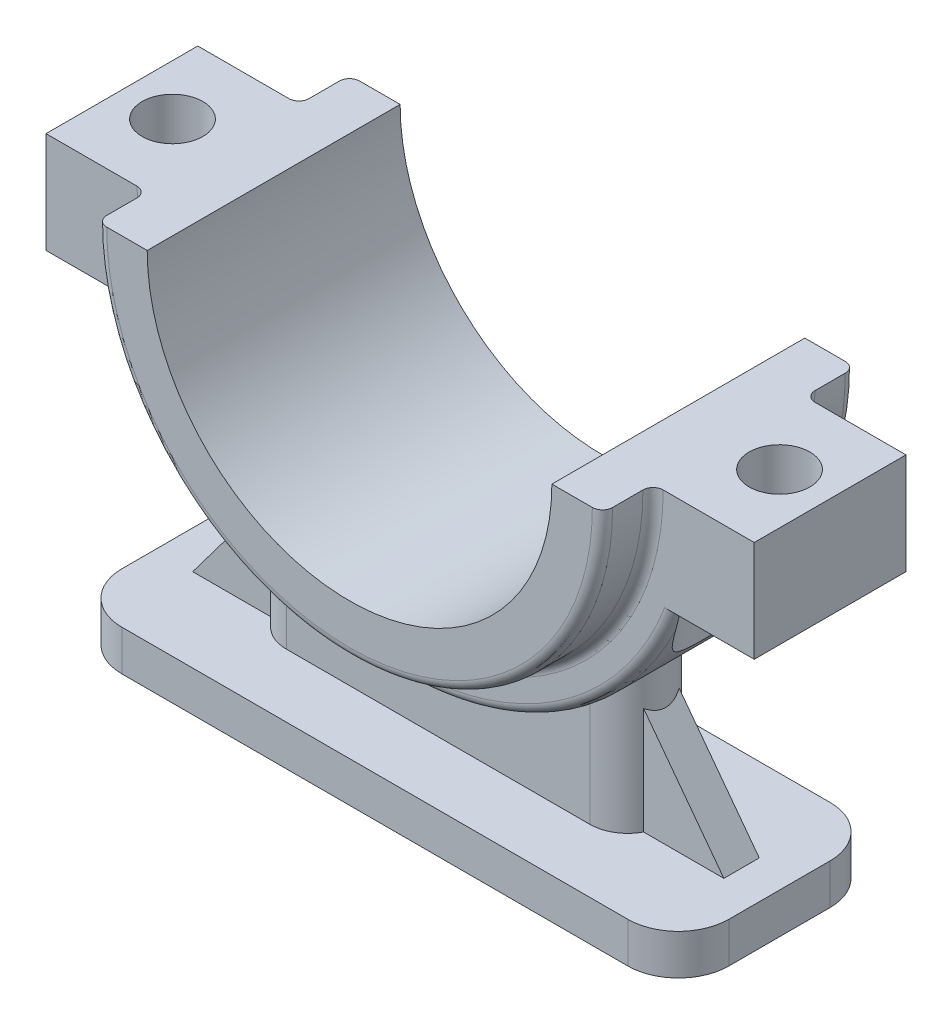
ISO-10303-21;
HEADER;
FILE_DESCRIPTION(('STEP AP214'),'2;1');
FILE_NAME('part.step','',(''),(''),'','','');
FILE_SCHEMA(('AUTOMOTIVE_DESIGN { 1 0 10303 214 1 1 1 1 }'));
ENDSEC;
DATA;
#1=APPLICATION_CONTEXT('core data for automotive mechanical design processes');
#2=APPLICATION_PROTOCOL_DEFINITION('international standard','automotive_design',2000,#1);
#3=PRODUCT_CONTEXT('',#1,'mechanical');
#4=PRODUCT('Part','Part','',(#3));
#5=PRODUCT_RELATED_PRODUCT_CATEGORY('part','',(#4));
#6=PRODUCT_DEFINITION_FORMATION('','',#4);
#7=PRODUCT_DEFINITION_CONTEXT('part definition',#1,'design');
#8=PRODUCT_DEFINITION('design','',#6,#7);
#9=PRODUCT_DEFINITION_SHAPE('','',#8);
#10=(LENGTH_UNIT() NAMED_UNIT(*) SI_UNIT(.MILLI.,.METRE.));
#11=(NAMED_UNIT(*) PLANE_ANGLE_UNIT() SI_UNIT($,.RADIAN.));
#12=(NAMED_UNIT(*) SI_UNIT($,.STERADIAN.) SOLID_ANGLE_UNIT());
#13=UNCERTAINTY_MEASURE_WITH_UNIT(LENGTH_MEASURE(1.E-05),#10,'distance_accuracy_value','');
#14=(GEOMETRIC_REPRESENTATION_CONTEXT(3) GLOBAL_UNCERTAINTY_ASSIGNED_CONTEXT((#13)) GLOBAL_UNIT_ASSIGNED_CONTEXT((#10,
#11,#12)) REPRESENTATION_CONTEXT('',''));
#15=CARTESIAN_POINT('',(0.,0.,0.));
#16=DIRECTION('',(0.,0.,1.));
#17=DIRECTION('',(1.,0.,0.));
#18=AXIS2_PLACEMENT_3D('',#15,#16,#17);
#19=CARTESIAN_POINT('',(0.,0.,15.));
#20=DIRECTION('',(0.,0.,-1.));
#21=DIRECTION('',(-1.,0.,0.));
#22=AXIS2_PLACEMENT_3D('',#19,#20,#21);
#23=CYLINDRICAL_SURFACE('',#22,58.);
#24=CARTESIAN_POINT('',(-30.,-49.6386945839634,-7.5));
#25=CARTESIAN_POINT('',(-30.2730932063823,-49.4736812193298,-7.49998636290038));
#26=CARTESIAN_POINT('',(-30.5447375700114,-49.3063977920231,-7.48508592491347));
#27=CARTESIAN_POINT('',(-31.0829797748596,-48.9688506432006,-7.42633708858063));
#28=CARTESIAN_POINT('',(-31.3495779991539,-48.7985871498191,-7.38249089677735));
#29=CARTESIAN_POINT('',(-31.8767952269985,-48.4558509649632,-7.26641750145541));
#30=CARTESIAN_POINT('',(-32.1373822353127,-48.2833718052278,-7.19406450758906));
#31=CARTESIAN_POINT('',(-32.6493769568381,-47.9386414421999,-7.0216639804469));
#32=CARTESIAN_POINT('',(-32.9007851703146,-47.7663902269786,-6.92161795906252));
#33=CARTESIAN_POINT('',(-33.3721063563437,-47.438149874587,-6.7037750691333));
#34=CARTESIAN_POINT('',(-33.5929031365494,-47.2819956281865,-6.58813516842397));
#35=CARTESIAN_POINT('',(-34.0236130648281,-46.9730134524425,-6.3342748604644));
#36=CARTESIAN_POINT('',(-34.2335259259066,-46.8201856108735,-6.19605385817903));
#37=CARTESIAN_POINT('',(-34.6403764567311,-46.5199749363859,-5.89749222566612));
#38=CARTESIAN_POINT('',(-34.8373390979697,-46.3725818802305,-5.73719612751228));
#39=CARTESIAN_POINT('',(-35.2166978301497,-46.0851485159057,-5.39457558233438));
#40=CARTESIAN_POINT('',(-35.3990990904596,-45.9451056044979,-5.21225901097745));
#41=CARTESIAN_POINT('',(-35.8249756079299,-45.6143861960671,-4.7392949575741));
#42=CARTESIAN_POINT('',(-36.059486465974,-45.4289260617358,-4.43655534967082));
#43=CARTESIAN_POINT('',(-36.3785717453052,-45.1732034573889,-3.94987514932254));
#44=CARTESIAN_POINT('',(-36.479479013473,-45.0917135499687,-3.78223660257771));
#45=CARTESIAN_POINT('',(-36.6692795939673,-44.937499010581,-3.43649923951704));
#46=CARTESIAN_POINT('',(-36.7581802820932,-44.8647690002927,-3.25840694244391));
#47=CARTESIAN_POINT('',(-36.9085994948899,-44.7410671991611,-2.92385030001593));
#48=CARTESIAN_POINT('',(-36.9721999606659,-44.6885023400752,-2.76890632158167));
#49=CARTESIAN_POINT('',(-37.0895095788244,-44.591188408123,-2.45300183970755));
#50=CARTESIAN_POINT('',(-37.1432235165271,-44.5464355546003,-2.29204429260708));
#51=CARTESIAN_POINT('',(-37.2400460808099,-44.4655254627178,-1.96489776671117));
#52=CARTESIAN_POINT('',(-37.283157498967,-44.4293659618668,-1.79871017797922));
#53=CARTESIAN_POINT('',(-37.3581303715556,-44.3663442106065,-1.4620703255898));
#54=CARTESIAN_POINT('',(-37.3899917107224,-44.3394820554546,-1.29161801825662));
#55=CARTESIAN_POINT('',(-37.4420518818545,-44.2955293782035,-0.9467929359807));
#56=CARTESIAN_POINT('',(-37.462191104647,-44.2784888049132,-0.77240472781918));
#57=CARTESIAN_POINT('',(-37.490184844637,-44.2547893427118,-0.421937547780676));
#58=CARTESIAN_POINT('',(-37.4980393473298,-44.2481304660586,-0.245858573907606));
#59=CARTESIAN_POINT('',(-37.5013130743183,-44.245355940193,0.106478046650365));
#60=CARTESIAN_POINT('',(-37.4967336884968,-44.2492391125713,0.282735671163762));
#61=CARTESIAN_POINT('',(-37.475230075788,-44.2674522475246,0.633943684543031));
#62=CARTESIAN_POINT('',(-37.4583064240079,-44.2817817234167,0.808894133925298));
#63=CARTESIAN_POINT('',(-37.4142979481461,-44.3189695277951,1.14196192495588));
#64=CARTESIAN_POINT('',(-37.3881493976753,-44.3410411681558,1.30029294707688));
#65=CARTESIAN_POINT('',(-37.3260804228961,-44.3933031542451,1.61371473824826));
#66=CARTESIAN_POINT('',(-37.2901567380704,-44.4234962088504,1.76880440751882));
#67=CARTESIAN_POINT('',(-37.209044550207,-44.4914575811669,2.07478271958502));
#68=CARTESIAN_POINT('',(-37.1638587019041,-44.5292237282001,2.22567255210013));
#69=CARTESIAN_POINT('',(-37.064755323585,-44.61174810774,2.52264745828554));
#70=CARTESIAN_POINT('',(-37.0108343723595,-44.6565090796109,2.66873062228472));
#71=CARTESIAN_POINT('',(-36.8905445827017,-44.7559409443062,2.96614249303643));
#72=CARTESIAN_POINT('',(-36.823548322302,-44.8111011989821,3.11705369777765));
#73=CARTESIAN_POINT('',(-36.6808884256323,-44.9279526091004,3.41212604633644));
#74=CARTESIAN_POINT('',(-36.6052219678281,-44.9896458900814,3.55628497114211));
#75=CARTESIAN_POINT('',(-36.3662721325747,-45.1833631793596,3.97806520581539));
#76=CARTESIAN_POINT('',(-36.1910272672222,-45.3240338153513,4.24501677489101));
#77=CARTESIAN_POINT('',(-35.725335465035,-45.6927169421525,4.86662656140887));
#78=CARTESIAN_POINT('',(-35.4193754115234,-45.9307782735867,5.20380089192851));
#79=CARTESIAN_POINT('',(-34.9272390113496,-46.3047627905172,5.65884110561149));
#80=CARTESIAN_POINT('',(-34.7574162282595,-46.4324182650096,5.80222223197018));
#81=CARTESIAN_POINT('',(-34.4078655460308,-46.6920350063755,6.07201921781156));
#82=CARTESIAN_POINT('',(-34.2281386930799,-46.8239958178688,6.19843686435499));
#83=CARTESIAN_POINT('',(-33.6714701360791,-47.2275676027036,6.5548482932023));
#84=CARTESIAN_POINT('',(-33.2808327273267,-47.5039660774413,6.75853190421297));
#85=CARTESIAN_POINT('',(-32.4729225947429,-48.0598537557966,7.09405991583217));
#86=CARTESIAN_POINT('',(-32.0556859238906,-48.3393383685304,7.22599934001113));
#87=CARTESIAN_POINT('',(-31.3633650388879,-48.7897536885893,7.38006745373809));
#88=CARTESIAN_POINT('',(-31.0939491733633,-48.9619110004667,7.42483987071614));
#89=CARTESIAN_POINT('',(-30.5502045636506,-49.303028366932,7.48477979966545));
#90=CARTESIAN_POINT('',(-30.2758804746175,-49.4719911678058,7.49997400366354));
#91=CARTESIAN_POINT('',(-30.,-49.6386945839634,7.5));
#92=B_SPLINE_CURVE_WITH_KNOTS('',3,(#24,#25,#26,#27,#28,#29,#30,#31,#32,#33,#34,#35,#36,#37,#38,
#39,#40,#41,#42,#43,#44,#45,#46,#47,#48,#49,#50,#51,#52,#53,#54,#55,#56,#57,#58,#59,#60,#61,#62,
#63,#64,#65,#66,#67,#68,#69,#70,#71,#72,#73,#74,#75,#76,#77,#78,#79,#80,#81,#82,#83,#84,#85,#86,
#87,#88,#89,#90,#91),.UNSPECIFIED.,.F.,.F.,(4,2,2,2,2,2,2,2,2,2,2,2,2,2,2,2,2,2,2,2,2,2,2,2,2,2,
2,2,2,2,2,2,2,4),(0.,0.9567769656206,1.91348100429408,2.87445478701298,3.83537611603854,
4.7166968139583,5.59804073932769,6.47763208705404,7.35690977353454,8.62765974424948,
9.26291971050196,9.8977876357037,10.4239131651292,10.9497833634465,11.4755149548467,
12.0012519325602,12.5296395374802,13.0580277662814,13.5863569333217,14.1146614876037,
14.6000840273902,15.0856686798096,15.5711143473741,16.0567506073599,16.5784930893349,
17.1004058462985,18.1441410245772,19.6767417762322,20.445060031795,21.2132972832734,
22.767286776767,24.3192130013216,25.2864376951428,26.2527891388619),.UNSPECIFIED.);
#93=CARTESIAN_POINT('',(-30.,-49.6386945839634,-7.5));
#94=VERTEX_POINT('',#93);
#95=CARTESIAN_POINT('',(-30.,-49.6386945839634,7.5));
#96=VERTEX_POINT('',#95);
#97=EDGE_CURVE('E404',#94,#96,#92,.T.);
#98=ORIENTED_EDGE('',*,*,#97,.T.);
#99=CARTESIAN_POINT('',(0.,0.,7.5));
#100=DIRECTION('',(0.,0.,-1.));
#101=DIRECTION('',(-1.,0.,0.));
#102=AXIS2_PLACEMENT_3D('',#99,#100,#101);
#103=CIRCLE('',#102,58.);
#104=CARTESIAN_POINT('',(30.,-49.6386945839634,7.50000000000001));
#105=VERTEX_POINT('',#104);
#106=EDGE_CURVE('E422',#96,#105,#103,.F.);
#107=ORIENTED_EDGE('',*,*,#106,.T.);
#108=CARTESIAN_POINT('',(30.,-49.6386945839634,7.50000000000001));
#109=CARTESIAN_POINT('',(30.2730932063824,-49.4736812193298,7.49998636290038));
#110=CARTESIAN_POINT('',(30.5447375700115,-49.3063977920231,7.48508592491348));
#111=CARTESIAN_POINT('',(31.0829797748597,-48.9688506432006,7.42633708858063));
#112=CARTESIAN_POINT('',(31.349577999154,-48.798587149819,7.38249089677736));
#113=CARTESIAN_POINT('',(31.8767952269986,-48.4558509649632,7.26641750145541));
#114=CARTESIAN_POINT('',(32.1373822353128,-48.2833718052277,7.19406450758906));
#115=CARTESIAN_POINT('',(32.6493769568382,-47.9386414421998,7.0216639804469));
#116=CARTESIAN_POINT('',(32.9007851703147,-47.7663902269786,6.92161795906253));
#117=CARTESIAN_POINT('',(33.3721063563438,-47.4381498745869,6.70377506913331));
#118=CARTESIAN_POINT('',(33.5929031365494,-47.2819956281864,6.58813516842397));
#119=CARTESIAN_POINT('',(34.0236130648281,-46.9730134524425,6.33427486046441));
#120=CARTESIAN_POINT('',(34.2335259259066,-46.8201856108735,6.19605385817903));
#121=CARTESIAN_POINT('',(34.6403764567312,-46.5199749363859,5.89749222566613));
#122=CARTESIAN_POINT('',(34.8373390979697,-46.3725818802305,5.73719612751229));
#123=CARTESIAN_POINT('',(35.2166978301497,-46.0851485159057,5.39457558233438));
#124=CARTESIAN_POINT('',(35.3990990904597,-45.9451056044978,5.21225901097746));
#125=CARTESIAN_POINT('',(35.8249756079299,-45.614386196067,4.7392949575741));
#126=CARTESIAN_POINT('',(36.0594864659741,-45.4289260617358,4.43655534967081));
#127=CARTESIAN_POINT('',(36.3785717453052,-45.1732034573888,3.94987514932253));
#128=CARTESIAN_POINT('',(36.479479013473,-45.0917135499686,3.7822366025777));
#129=CARTESIAN_POINT('',(36.6692795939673,-44.937499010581,3.43649923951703));
#130=CARTESIAN_POINT('',(36.7581802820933,-44.8647690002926,3.25840694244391));
#131=CARTESIAN_POINT('',(36.90859949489,-44.7410671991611,2.92385030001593));
#132=CARTESIAN_POINT('',(36.9721999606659,-44.6885023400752,2.76890632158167));
#133=CARTESIAN_POINT('',(37.0895095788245,-44.591188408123,2.45300183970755));
#134=CARTESIAN_POINT('',(37.1432235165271,-44.5464355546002,2.29204429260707));
#135=CARTESIAN_POINT('',(37.2400460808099,-44.4655254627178,1.96489776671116));
#136=CARTESIAN_POINT('',(37.2831574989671,-44.4293659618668,1.79871017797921));
#137=CARTESIAN_POINT('',(37.3581303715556,-44.3663442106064,1.4620703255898));
#138=CARTESIAN_POINT('',(37.3899917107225,-44.3394820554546,1.29161801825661));
#139=CARTESIAN_POINT('',(37.4420518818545,-44.2955293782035,0.946792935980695));
#140=CARTESIAN_POINT('',(37.462191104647,-44.2784888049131,0.772404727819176));
#141=CARTESIAN_POINT('',(37.4901848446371,-44.2547893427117,0.421937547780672));
#142=CARTESIAN_POINT('',(37.4980393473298,-44.2481304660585,0.245858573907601));
#143=CARTESIAN_POINT('',(37.5013130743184,-44.245355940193,-0.10647804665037));
#144=CARTESIAN_POINT('',(37.4967336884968,-44.2492391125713,-0.282735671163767));
#145=CARTESIAN_POINT('',(37.4752300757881,-44.2674522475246,-0.633943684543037));
#146=CARTESIAN_POINT('',(37.458306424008,-44.2817817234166,-0.808894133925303));
#147=CARTESIAN_POINT('',(37.4142979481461,-44.3189695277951,-1.14196192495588));
#148=CARTESIAN_POINT('',(37.3881493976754,-44.3410411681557,-1.30029294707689));
#149=CARTESIAN_POINT('',(37.3260804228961,-44.3933031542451,-1.61371473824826));
#150=CARTESIAN_POINT('',(37.2901567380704,-44.4234962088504,-1.76880440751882));
#151=CARTESIAN_POINT('',(37.2090445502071,-44.4914575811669,-2.07478271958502));
#152=CARTESIAN_POINT('',(37.1638587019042,-44.5292237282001,-2.22567255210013));
#153=CARTESIAN_POINT('',(37.064755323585,-44.6117481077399,-2.52264745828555));
#154=CARTESIAN_POINT('',(37.0108343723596,-44.6565090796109,-2.66873062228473));
#155=CARTESIAN_POINT('',(36.8905445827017,-44.7559409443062,-2.96614249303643));
#156=CARTESIAN_POINT('',(36.823548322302,-44.811101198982,-3.11705369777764));
#157=CARTESIAN_POINT('',(36.6808884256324,-44.9279526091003,-3.41212604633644));
#158=CARTESIAN_POINT('',(36.6052219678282,-44.9896458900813,-3.55628497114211));
#159=CARTESIAN_POINT('',(36.3662721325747,-45.1833631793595,-3.97806520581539));
#160=CARTESIAN_POINT('',(36.1910272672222,-45.3240338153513,-4.24501677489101));
#161=CARTESIAN_POINT('',(35.7253354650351,-45.6927169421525,-4.86662656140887));
#162=CARTESIAN_POINT('',(35.4193754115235,-45.9307782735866,-5.20380089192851));
#163=CARTESIAN_POINT('',(34.9272390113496,-46.3047627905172,-5.65884110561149));
#164=CARTESIAN_POINT('',(34.7574162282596,-46.4324182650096,-5.80222223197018));
#165=CARTESIAN_POINT('',(34.4078655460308,-46.6920350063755,-6.07201921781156));
#166=CARTESIAN_POINT('',(34.22813869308,-46.8239958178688,-6.19843686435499));
#167=CARTESIAN_POINT('',(33.6714701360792,-47.2275676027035,-6.5548482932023));
#168=CARTESIAN_POINT('',(33.2808327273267,-47.5039660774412,-6.75853190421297));
#169=CARTESIAN_POINT('',(32.472922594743,-48.0598537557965,-7.09405991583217));
#170=CARTESIAN_POINT('',(32.0556859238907,-48.3393383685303,-7.22599934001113));
#171=CARTESIAN_POINT('',(31.363365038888,-48.7897536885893,-7.38006745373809));
#172=CARTESIAN_POINT('',(31.0939491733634,-48.9619110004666,-7.42483987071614));
#173=CARTESIAN_POINT('',(30.5502045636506,-49.303028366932,-7.48477979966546));
#174=CARTESIAN_POINT('',(30.2758804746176,-49.4719911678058,-7.49997400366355));
#175=CARTESIAN_POINT('',(30.,-49.6386945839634,-7.50000000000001));
#176=B_SPLINE_CURVE_WITH_KNOTS('',3,(#108,#109,#110,#111,#112,#113,#114,#115,#116,#117,#118,
#119,#120,#121,#122,#123,#124,#125,#126,#127,#128,#129,#130,#131,#132,#133,#134,#135,#136,#137,
#138,#139,#140,#141,#142,#143,#144,#145,#146,#147,#148,#149,#150,#151,#152,#153,#154,#155,#156,
#157,#158,#159,#160,#161,#162,#163,#164,#165,#166,#167,#168,#169,#170,#171,#172,#173,#174,#175),
.UNSPECIFIED.,.F.,.F.,(4,2,2,2,2,2,2,2,2,2,2,2,2,2,2,2,2,2,2,2,2,2,2,2,2,2,2,2,2,2,2,2,2,4),(0.,
0.956776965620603,1.91348100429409,2.87445478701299,3.83537611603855,4.7166968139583,
5.59804073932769,6.47763208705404,7.35690977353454,8.6276597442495,9.26291971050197,
9.89778763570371,10.4239131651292,10.9497833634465,11.4755149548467,12.0012519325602,
12.5296395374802,13.0580277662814,13.5863569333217,14.1146614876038,14.6000840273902,
15.0856686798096,15.5711143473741,16.0567506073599,16.5784930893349,17.1004058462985,
18.1441410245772,19.6767417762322,20.445060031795,21.2132972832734,22.767286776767,
24.3192130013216,25.2864376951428,26.2527891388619),.UNSPECIFIED.);
#177=CARTESIAN_POINT('',(30.,-49.6386945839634,-7.50000000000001));
#178=VERTEX_POINT('',#177);
#179=EDGE_CURVE('E432',#105,#178,#176,.T.);
#180=ORIENTED_EDGE('',*,*,#179,.T.);
#181=CARTESIAN_POINT('',(0.,0.,-7.50000000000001));
#182=DIRECTION('',(0.,0.,1.));
#183=DIRECTION('',(1.,0.,0.));
#184=AXIS2_PLACEMENT_3D('',#181,#182,#183);
#185=CIRCLE('',#184,58.);
#186=EDGE_CURVE('E384',#178,#94,#185,.F.);
#187=ORIENTED_EDGE('',*,*,#186,.T.);
#188=EDGE_LOOP('',(#98,#107,#180,#187));
#189=FACE_BOUND('',#188,.T.);
#190=CARTESIAN_POINT('',(0.,0.,13.));
#191=DIRECTION('',(0.,0.,1.));
#192=DIRECTION('',(1.,0.,0.));
#193=AXIS2_PLACEMENT_3D('',#190,#191,#192);
#194=CIRCLE('',#193,58.);
#195=CARTESIAN_POINT('',(52.5166852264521,-24.617022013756,13.));
#196=VERTEX_POINT('',#195);
#197=CARTESIAN_POINT('',(-52.5166852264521,-24.617022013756,13.));
#198=VERTEX_POINT('',#197);
#199=EDGE_CURVE('E897',#196,#198,#194,.F.);
#200=ORIENTED_EDGE('',*,*,#199,.T.);
#201=CARTESIAN_POINT('',(-54.4426303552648,-20.,-13.9325389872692));
#202=CARTESIAN_POINT('',(-54.2736709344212,-20.4599693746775,-13.8651048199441));
#203=CARTESIAN_POINT('',(-54.0991111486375,-20.9170965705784,-13.7919514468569));
#204=CARTESIAN_POINT('',(-53.7392694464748,-21.8249631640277,-13.632399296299));
#205=CARTESIAN_POINT('',(-53.5539836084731,-22.275700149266,-13.5459956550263));
#206=CARTESIAN_POINT('',(-53.1719658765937,-23.1728610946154,-13.3575279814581));
#207=CARTESIAN_POINT('',(-52.9751631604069,-23.6192330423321,-13.25535892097));
#208=CARTESIAN_POINT('',(-52.5720869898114,-24.5032979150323,-13.0337647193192));
#209=CARTESIAN_POINT('',(-52.365814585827,-24.9409917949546,-12.9143414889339));
#210=CARTESIAN_POINT('',(-51.9409541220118,-25.8142845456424,-12.6536563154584));
#211=CARTESIAN_POINT('',(-51.7222108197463,-26.249702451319,-12.5120385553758));
#212=CARTESIAN_POINT('',(-51.2772276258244,-27.1086678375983,-12.2059894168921));
#213=CARTESIAN_POINT('',(-51.0509866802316,-27.5322136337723,-12.0415548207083));
#214=CARTESIAN_POINT('',(-50.5935040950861,-28.3640965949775,-11.6876525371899));
#215=CARTESIAN_POINT('',(-50.3622796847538,-28.7724759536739,-11.4982622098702));
#216=CARTESIAN_POINT('',(-49.8965249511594,-29.5728074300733,-11.0912310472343));
#217=CARTESIAN_POINT('',(-49.6619960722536,-29.9647664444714,-10.8736022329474));
#218=CARTESIAN_POINT('',(-49.2473933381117,-30.640048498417,-10.4616303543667));
#219=CARTESIAN_POINT('',(-49.0674010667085,-30.9273543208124,-10.2737296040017));
#220=CARTESIAN_POINT('',(-48.708791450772,-31.4891192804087,-9.87825245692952));
#221=CARTESIAN_POINT('',(-48.5301742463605,-31.7635771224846,-9.67067408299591));
#222=CARTESIAN_POINT('',(-48.1768207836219,-32.2969966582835,-9.23530169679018));
#223=CARTESIAN_POINT('',(-48.0020747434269,-32.5560011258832,-9.00756827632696));
#224=CARTESIAN_POINT('',(-47.6582399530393,-33.0572916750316,-8.53038255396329));
#225=CARTESIAN_POINT('',(-47.4891510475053,-33.2995782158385,-8.28093084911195));
#226=CARTESIAN_POINT('',(-47.1570564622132,-33.7682636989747,-7.75606461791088));
#227=CARTESIAN_POINT('',(-46.9941652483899,-33.9944007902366,-7.48034231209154));
#228=CARTESIAN_POINT('',(-46.6801670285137,-34.424306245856,-6.90573494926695));
#229=CARTESIAN_POINT('',(-46.5290570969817,-34.6280801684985,-6.60685567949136));
#230=CARTESIAN_POINT('',(-46.2422496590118,-35.0101610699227,-5.98672460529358));
#231=CARTESIAN_POINT('',(-46.1065352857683,-35.1884959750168,-5.66549791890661));
#232=CARTESIAN_POINT('',(-45.854069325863,-35.51685883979,-5.00184975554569));
#233=CARTESIAN_POINT('',(-45.7373092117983,-35.6668995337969,-4.65943790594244));
#234=CARTESIAN_POINT('',(-45.5568083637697,-35.8969636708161,-4.05741105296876));
#235=CARTESIAN_POINT('',(-45.4874868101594,-35.984702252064,-3.80238536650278));
#236=CARTESIAN_POINT('',(-45.3615064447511,-36.1433812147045,-3.28413746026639));
#237=CARTESIAN_POINT('',(-45.3048445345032,-36.2143257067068,-3.02091726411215));
#238=CARTESIAN_POINT('',(-45.205275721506,-36.3385386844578,-2.48789319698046));
#239=CARTESIAN_POINT('',(-45.1623631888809,-36.3918144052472,-2.21809206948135));
#240=CARTESIAN_POINT('',(-45.091127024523,-36.4800423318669,-1.67358565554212));
#241=CARTESIAN_POINT('',(-45.0628039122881,-36.5149938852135,-1.39888019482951));
#242=CARTESIAN_POINT('',(-45.0212896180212,-36.5661671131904,-0.845789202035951));
#243=CARTESIAN_POINT('',(-45.0081419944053,-36.5823348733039,-0.567395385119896));
#244=CARTESIAN_POINT('',(-44.9974121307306,-36.5955321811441,-0.00985383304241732));
#245=CARTESIAN_POINT('',(-44.9998298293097,-36.5925618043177,0.269293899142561));
#246=CARTESIAN_POINT('',(-45.0201772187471,-36.5675252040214,0.826161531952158));
#247=CARTESIAN_POINT('',(-45.0381070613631,-36.545458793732,1.1038814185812));
#248=CARTESIAN_POINT('',(-45.0890905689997,-36.4825375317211,1.65577047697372));
#249=CARTESIAN_POINT('',(-45.1221440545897,-36.4416829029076,1.92993969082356));
#250=CARTESIAN_POINT('',(-45.2010301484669,-36.3437841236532,2.46165852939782));
#251=CARTESIAN_POINT('',(-45.2462851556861,-36.2874700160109,2.71942939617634));
#252=CARTESIAN_POINT('',(-45.3492269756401,-36.1587388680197,3.22835112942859));
#253=CARTESIAN_POINT('',(-45.4069130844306,-36.0863227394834,3.47950236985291));
#254=CARTESIAN_POINT('',(-45.5337337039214,-35.926167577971,3.97395259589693));
#255=CARTESIAN_POINT('',(-45.60287080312,-35.8384250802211,4.21724979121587));
#256=CARTESIAN_POINT('',(-45.7514781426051,-35.6485172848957,4.69491468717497));
#257=CARTESIAN_POINT('',(-45.8309504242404,-35.546349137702,4.92928061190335));
#258=CARTESIAN_POINT('',(-46.0269340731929,-35.2924193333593,5.46436532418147));
#259=CARTESIAN_POINT('',(-46.1469907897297,-35.135444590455,5.76132668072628));
#260=CARTESIAN_POINT('',(-46.400554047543,-34.7998965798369,6.33671884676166));
#261=CARTESIAN_POINT('',(-46.534064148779,-34.6213175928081,6.61514471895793));
#262=CARTESIAN_POINT('',(-46.8118908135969,-34.2447313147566,7.15300269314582));
#263=CARTESIAN_POINT('',(-46.9562131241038,-34.0467136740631,7.4124245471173));
#264=CARTESIAN_POINT('',(-47.253122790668,-33.6334239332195,7.91211936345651));
#265=CARTESIAN_POINT('',(-47.4057124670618,-33.4181469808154,8.15238690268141));
#266=CARTESIAN_POINT('',(-47.7809115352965,-32.8805629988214,8.70909298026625));
#267=CARTESIAN_POINT('',(-48.0065031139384,-32.5506570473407,9.01620709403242));
#268=CARTESIAN_POINT('',(-48.4642146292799,-31.8651843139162,9.59488842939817));
#269=CARTESIAN_POINT('',(-48.6963374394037,-31.5096061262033,9.86643969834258));
#270=CARTESIAN_POINT('',(-49.1640289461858,-30.774811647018,10.3779824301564));
#271=CARTESIAN_POINT('',(-49.399609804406,-30.3954706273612,10.6177824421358));
#272=CARTESIAN_POINT('',(-49.8693379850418,-29.6184944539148,11.0668543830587));
#273=CARTESIAN_POINT('',(-50.1034855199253,-29.2208620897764,11.2761309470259));
#274=CARTESIAN_POINT('',(-50.5298173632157,-28.476140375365,11.6352963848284));
#275=CARTESIAN_POINT('',(-50.722622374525,-28.1313731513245,11.789305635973));
#276=CARTESIAN_POINT('',(-51.1041164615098,-27.432241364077,12.079765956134));
#277=CARTESIAN_POINT('',(-51.2928049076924,-27.0778753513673,12.2162143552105));
#278=CARTESIAN_POINT('',(-51.6652432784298,-26.3603161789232,12.4732951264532));
#279=CARTESIAN_POINT('',(-51.8489867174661,-25.9971125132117,12.5939074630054));
#280=CARTESIAN_POINT('',(-52.2104817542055,-25.26327200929,12.8206445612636));
#281=CARTESIAN_POINT('',(-52.3882330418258,-24.8926347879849,12.9267685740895));
#282=CARTESIAN_POINT('',(-52.7335014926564,-24.1524567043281,13.1238980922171));
#283=CARTESIAN_POINT('',(-52.9011537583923,-23.783049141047,13.2151689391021));
#284=CARTESIAN_POINT('',(-53.2295876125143,-23.0385883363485,13.3864036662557));
#285=CARTESIAN_POINT('',(-53.3903688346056,-22.663534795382,13.4663669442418));
#286=CARTESIAN_POINT('',(-53.7041466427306,-21.909604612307,13.6158868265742));
#287=CARTESIAN_POINT('',(-53.8571665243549,-21.5307440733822,13.6854759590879));
#288=CARTESIAN_POINT('',(-54.1556398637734,-20.7685899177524,13.8155638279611));
#289=CARTESIAN_POINT('',(-54.3010947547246,-20.3852971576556,13.8760642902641));
#290=CARTESIAN_POINT('',(-54.4426303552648,-20.0000000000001,13.9325389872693));
#291=B_SPLINE_CURVE_WITH_KNOTS('',3,(#201,#202,#203,#204,#205,#206,#207,#208,#209,#210,#211,
#212,#213,#214,#215,#216,#217,#218,#219,#220,#221,#222,#223,#224,#225,#226,#227,#228,#229,#230,
#231,#232,#233,#234,#235,#236,#237,#238,#239,#240,#241,#242,#243,#244,#245,#246,#247,#248,#249,
#250,#251,#252,#253,#254,#255,#256,#257,#258,#259,#260,#261,#262,#263,#264,#265,#266,#267,#268,
#269,#270,#271,#272,#273,#274,#275,#276,#277,#278,#279,#280,#281,#282,#283,#284,#285,#286,#287,
#288,#289,#290),.UNSPECIFIED.,.F.,.F.,(4,2,2,2,2,2,2,2,2,2,2,2,2,2,2,2,2,2,2,2,2,2,2,2,2,2,2,2,
2,2,2,2,2,2,2,2,2,2,2,2,2,2,2,2,4),(0.,1.48391457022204,2.96837515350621,4.46318990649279,
5.95783924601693,7.47951277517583,9.00140111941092,10.5186781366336,12.0353113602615,
13.1975413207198,14.3598881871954,15.5188522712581,16.6777845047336,17.8525280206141,
19.026978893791,20.2001303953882,21.3727526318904,22.2073136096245,23.0416701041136,
23.8756845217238,24.7097286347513,25.5461608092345,26.3825896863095,27.2190267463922,
28.055453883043,28.857690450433,29.6598816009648,30.4622543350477,31.2647857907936,
32.3333420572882,33.4021818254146,34.4715937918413,35.5413074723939,37.0510652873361,
38.5614980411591,40.0806594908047,41.5995900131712,42.8710127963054,44.1426286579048,
45.4158381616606,46.6891134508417,47.9362853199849,49.1835235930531,50.4267649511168,
51.6697699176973),.UNSPECIFIED.);
#292=CARTESIAN_POINT('',(-52.5166852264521,-24.617022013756,-13.));
#293=VERTEX_POINT('',#292);
#294=EDGE_CURVE('E590',#293,#198,#291,.T.);
#295=ORIENTED_EDGE('',*,*,#294,.F.);
#296=CARTESIAN_POINT('',(0.,0.,-13.));
#297=DIRECTION('',(0.,0.,1.));
#298=DIRECTION('',(1.,0.,0.));
#299=AXIS2_PLACEMENT_3D('',#296,#297,#298);
#300=CIRCLE('',#299,58.);
#301=CARTESIAN_POINT('',(52.5166852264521,-24.617022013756,-13.));
#302=VERTEX_POINT('',#301);
#303=EDGE_CURVE('E906',#293,#302,#300,.T.);
#304=ORIENTED_EDGE('',*,*,#303,.T.);
#305=CARTESIAN_POINT('',(54.4426303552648,-20.,-13.9325389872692));
#306=CARTESIAN_POINT('',(54.2736709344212,-20.4599693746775,-13.8651048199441));
#307=CARTESIAN_POINT('',(54.0991111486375,-20.9170965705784,-13.7919514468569));
#308=CARTESIAN_POINT('',(53.7392694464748,-21.8249631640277,-13.632399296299));
#309=CARTESIAN_POINT('',(53.5539836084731,-22.275700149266,-13.5459956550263));
#310=CARTESIAN_POINT('',(53.1719658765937,-23.1728610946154,-13.3575279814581));
#311=CARTESIAN_POINT('',(52.9751631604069,-23.6192330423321,-13.25535892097));
#312=CARTESIAN_POINT('',(52.5720869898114,-24.5032979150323,-13.0337647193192));
#313=CARTESIAN_POINT('',(52.365814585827,-24.9409917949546,-12.9143414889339));
#314=CARTESIAN_POINT('',(51.9409541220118,-25.8142845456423,-12.6536563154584));
#315=CARTESIAN_POINT('',(51.7222108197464,-26.249702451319,-12.5120385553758));
#316=CARTESIAN_POINT('',(51.2772276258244,-27.1086678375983,-12.2059894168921));
#317=CARTESIAN_POINT('',(51.0509866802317,-27.5322136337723,-12.0415548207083));
#318=CARTESIAN_POINT('',(50.5935040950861,-28.3640965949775,-11.6876525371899));
#319=CARTESIAN_POINT('',(50.3622796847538,-28.7724759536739,-11.4982622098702));
#320=CARTESIAN_POINT('',(49.8965249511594,-29.5728074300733,-11.0912310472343));
#321=CARTESIAN_POINT('',(49.6619960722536,-29.9647664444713,-10.8736022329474));
#322=CARTESIAN_POINT('',(49.2473933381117,-30.640048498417,-10.4616303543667));
#323=CARTESIAN_POINT('',(49.0674010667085,-30.9273543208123,-10.2737296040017));
#324=CARTESIAN_POINT('',(48.708791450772,-31.4891192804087,-9.87825245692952));
#325=CARTESIAN_POINT('',(48.5301742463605,-31.7635771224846,-9.67067408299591));
#326=CARTESIAN_POINT('',(48.1768207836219,-32.2969966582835,-9.23530169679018));
#327=CARTESIAN_POINT('',(48.0020747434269,-32.5560011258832,-9.00756827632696));
#328=CARTESIAN_POINT('',(47.6582399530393,-33.0572916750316,-8.53038255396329));
#329=CARTESIAN_POINT('',(47.4891510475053,-33.2995782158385,-8.28093084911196));
#330=CARTESIAN_POINT('',(47.1570564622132,-33.7682636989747,-7.75606461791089));
#331=CARTESIAN_POINT('',(46.9941652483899,-33.9944007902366,-7.48034231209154));
#332=CARTESIAN_POINT('',(46.6801670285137,-34.424306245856,-6.90573494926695));
#333=CARTESIAN_POINT('',(46.5290570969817,-34.6280801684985,-6.60685567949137));
#334=CARTESIAN_POINT('',(46.2422496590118,-35.0101610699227,-5.98672460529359));
#335=CARTESIAN_POINT('',(46.1065352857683,-35.1884959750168,-5.66549791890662));
#336=CARTESIAN_POINT('',(45.854069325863,-35.51685883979,-5.0018497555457));
#337=CARTESIAN_POINT('',(45.7373092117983,-35.6668995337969,-4.65943790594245));
#338=CARTESIAN_POINT('',(45.5568083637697,-35.8969636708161,-4.05741105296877));
#339=CARTESIAN_POINT('',(45.4874868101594,-35.9847022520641,-3.80238536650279));
#340=CARTESIAN_POINT('',(45.3615064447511,-36.1433812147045,-3.2841374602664));
#341=CARTESIAN_POINT('',(45.3048445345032,-36.2143257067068,-3.02091726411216));
#342=CARTESIAN_POINT('',(45.205275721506,-36.3385386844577,-2.48789319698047));
#343=CARTESIAN_POINT('',(45.1623631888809,-36.3918144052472,-2.21809206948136));
#344=CARTESIAN_POINT('',(45.091127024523,-36.4800423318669,-1.67358565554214));
#345=CARTESIAN_POINT('',(45.0628039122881,-36.5149938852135,-1.39888019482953));
#346=CARTESIAN_POINT('',(45.0212896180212,-36.5661671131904,-0.845789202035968));
#347=CARTESIAN_POINT('',(45.0081419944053,-36.5823348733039,-0.567395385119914));
#348=CARTESIAN_POINT('',(44.9974121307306,-36.5955321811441,-0.00985383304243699));
#349=CARTESIAN_POINT('',(44.9998298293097,-36.5925618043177,0.269293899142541));
#350=CARTESIAN_POINT('',(45.0201772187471,-36.5675252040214,0.826161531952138));
#351=CARTESIAN_POINT('',(45.0381070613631,-36.545458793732,1.10388141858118));
#352=CARTESIAN_POINT('',(45.0890905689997,-36.4825375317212,1.6557704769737));
#353=CARTESIAN_POINT('',(45.1221440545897,-36.4416829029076,1.92993969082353));
#354=CARTESIAN_POINT('',(45.2010301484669,-36.3437841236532,2.46165852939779));
#355=CARTESIAN_POINT('',(45.2462851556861,-36.2874700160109,2.71942939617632));
#356=CARTESIAN_POINT('',(45.3492269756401,-36.1587388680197,3.22835112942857));
#357=CARTESIAN_POINT('',(45.4069130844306,-36.0863227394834,3.47950236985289));
#358=CARTESIAN_POINT('',(45.5337337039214,-35.926167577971,3.9739525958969));
#359=CARTESIAN_POINT('',(45.60287080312,-35.8384250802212,4.21724979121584));
#360=CARTESIAN_POINT('',(45.7514781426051,-35.6485172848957,4.69491468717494));
#361=CARTESIAN_POINT('',(45.8309504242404,-35.546349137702,4.92928061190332));
#362=CARTESIAN_POINT('',(46.0269340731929,-35.2924193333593,5.46436532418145));
#363=CARTESIAN_POINT('',(46.1469907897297,-35.135444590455,5.76132668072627));
#364=CARTESIAN_POINT('',(46.400554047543,-34.799896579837,6.33671884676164));
#365=CARTESIAN_POINT('',(46.534064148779,-34.6213175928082,6.61514471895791));
#366=CARTESIAN_POINT('',(46.8118908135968,-34.2447313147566,7.1530026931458));
#367=CARTESIAN_POINT('',(46.9562131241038,-34.0467136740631,7.41242454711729));
#368=CARTESIAN_POINT('',(47.253122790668,-33.6334239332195,7.91211936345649));
#369=CARTESIAN_POINT('',(47.4057124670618,-33.4181469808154,8.15238690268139));
#370=CARTESIAN_POINT('',(47.7809115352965,-32.8805629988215,8.70909298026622));
#371=CARTESIAN_POINT('',(48.0065031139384,-32.5506570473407,9.01620709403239));
#372=CARTESIAN_POINT('',(48.4642146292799,-31.8651843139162,9.59488842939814));
#373=CARTESIAN_POINT('',(48.6963374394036,-31.5096061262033,9.86643969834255));
#374=CARTESIAN_POINT('',(49.1640289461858,-30.7748116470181,10.3779824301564));
#375=CARTESIAN_POINT('',(49.3996098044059,-30.3954706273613,10.6177824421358));
#376=CARTESIAN_POINT('',(49.8693379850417,-29.6184944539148,11.0668543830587));
#377=CARTESIAN_POINT('',(50.1034855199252,-29.2208620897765,11.2761309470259));
#378=CARTESIAN_POINT('',(50.5298173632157,-28.476140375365,11.6352963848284));
#379=CARTESIAN_POINT('',(50.722622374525,-28.1313731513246,11.7893056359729));
#380=CARTESIAN_POINT('',(51.1041164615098,-27.432241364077,12.079765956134));
#381=CARTESIAN_POINT('',(51.2928049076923,-27.0778753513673,12.2162143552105));
#382=CARTESIAN_POINT('',(51.6652432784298,-26.3603161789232,12.4732951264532));
#383=CARTESIAN_POINT('',(51.8489867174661,-25.9971125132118,12.5939074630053));
#384=CARTESIAN_POINT('',(52.2104817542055,-25.26327200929,12.8206445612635));
#385=CARTESIAN_POINT('',(52.3882330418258,-24.892634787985,12.9267685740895));
#386=CARTESIAN_POINT('',(52.7335014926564,-24.1524567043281,13.1238980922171));
#387=CARTESIAN_POINT('',(52.9011537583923,-23.783049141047,13.2151689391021));
#388=CARTESIAN_POINT('',(53.2295876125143,-23.0385883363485,13.3864036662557));
#389=CARTESIAN_POINT('',(53.3903688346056,-22.663534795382,13.4663669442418));
#390=CARTESIAN_POINT('',(53.7041466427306,-21.909604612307,13.6158868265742));
#391=CARTESIAN_POINT('',(53.8571665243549,-21.5307440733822,13.6854759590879));
#392=CARTESIAN_POINT('',(54.1556398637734,-20.7685899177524,13.8155638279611));
#393=CARTESIAN_POINT('',(54.3010947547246,-20.3852971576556,13.8760642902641));
#394=CARTESIAN_POINT('',(54.4426303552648,-20.,13.9325389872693));
#395=B_SPLINE_CURVE_WITH_KNOTS('',3,(#305,#306,#307,#308,#309,#310,#311,#312,#313,#314,#315,
#316,#317,#318,#319,#320,#321,#322,#323,#324,#325,#326,#327,#328,#329,#330,#331,#332,#333,#334,
#335,#336,#337,#338,#339,#340,#341,#342,#343,#344,#345,#346,#347,#348,#349,#350,#351,#352,#353,
#354,#355,#356,#357,#358,#359,#360,#361,#362,#363,#364,#365,#366,#367,#368,#369,#370,#371,#372,
#373,#374,#375,#376,#377,#378,#379,#380,#381,#382,#383,#384,#385,#386,#387,#388,#389,#390,#391,
#392,#393,#394),.UNSPECIFIED.,.F.,.F.,(4,2,2,2,2,2,2,2,2,2,2,2,2,2,2,2,2,2,2,2,2,2,2,2,2,2,2,2,
2,2,2,2,2,2,2,2,2,2,2,2,2,2,2,2,4),(0.,1.48391457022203,2.9683751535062,4.46318990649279,
5.95783924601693,7.47951277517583,9.00140111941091,10.5186781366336,12.0353113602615,
13.1975413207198,14.3598881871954,15.5188522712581,16.6777845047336,17.8525280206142,
19.026978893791,20.2001303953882,21.3727526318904,22.2073136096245,23.0416701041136,
23.8756845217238,24.7097286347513,25.5461608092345,26.3825896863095,27.2190267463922,
28.055453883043,28.857690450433,29.6598816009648,30.4622543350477,31.2647857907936,
32.3333420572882,33.4021818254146,34.4715937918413,35.5413074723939,37.0510652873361,
38.5614980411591,40.0806594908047,41.5995900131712,42.8710127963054,44.1426286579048,
45.4158381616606,46.6891134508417,47.9362853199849,49.1835235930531,50.4267649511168,
51.6697699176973),.UNSPECIFIED.);
#396=EDGE_CURVE('E461',#302,#196,#395,.T.);
#397=ORIENTED_EDGE('',*,*,#396,.T.);
#398=EDGE_LOOP('',(#200,#295,#304,#397));
#399=FACE_BOUND('',#398,.T.);
#400=ADVANCED_FACE('F43',(#189,#399),#23,.T.);
#401=CARTESIAN_POINT('',(54.4426303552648,-20.,15.));
#402=DIRECTION('',(0.,1.,0.));
#403=DIRECTION('',(0.,0.,1.));
#404=AXIS2_PLACEMENT_3D('',#401,#402,#403);
#405=PLANE('',#404);
#406=CARTESIAN_POINT('',(60.,-20.,0.));
#407=DIRECTION('',(0.,1.,0.));
#408=DIRECTION('',(0.,0.,-1.));
#409=AXIS2_PLACEMENT_3D('',#406,#407,#408);
#410=CIRCLE('',#409,6.);
#411=CARTESIAN_POINT('',(60.,-20.,-6.));
#412=VERTEX_POINT('',#411);
#413=EDGE_CURVE('E770',#412,#412,#410,.T.);
#414=ORIENTED_EDGE('',*,*,#413,.T.);
#415=EDGE_LOOP('',(#414));
#416=FACE_BOUND('',#415,.T.);
#417=CARTESIAN_POINT('',(52.3067873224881,-20.,15.));
#418=CARTESIAN_POINT('',(52.3700881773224,-20.,14.9999972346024));
#419=CARTESIAN_POINT('',(52.4333600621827,-20.,14.997376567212));
#420=CARTESIAN_POINT('',(52.5594755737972,-20.,14.9868987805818));
#421=CARTESIAN_POINT('',(52.6223191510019,-20.,14.9790410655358));
#422=CARTESIAN_POINT('',(52.8096497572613,-20.,14.9476089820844));
#423=CARTESIAN_POINT('',(52.9329165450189,-20.,14.9161756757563));
#424=CARTESIAN_POINT('',(53.1724352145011,-20.,14.8328193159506));
#425=CARTESIAN_POINT('',(53.2886789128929,-20.,14.7808728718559));
#426=CARTESIAN_POINT('',(53.5103525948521,-20.,14.6574520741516));
#427=CARTESIAN_POINT('',(53.615784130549,-20.,14.5859805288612));
#428=CARTESIAN_POINT('',(53.8084524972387,-20.,14.4281082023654));
#429=CARTESIAN_POINT('',(53.8962112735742,-20.,14.3423443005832));
#430=CARTESIAN_POINT('',(54.0546887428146,-20.,14.1565322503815));
#431=CARTESIAN_POINT('',(54.125453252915,-20.,14.0565236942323));
#432=CARTESIAN_POINT('',(54.2053417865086,-20.,13.917909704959));
#433=CARTESIAN_POINT('',(54.2234243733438,-20.,13.8842994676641));
#434=CARTESIAN_POINT('',(54.2404837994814,-20.,13.8501975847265));
#435=B_SPLINE_CURVE_WITH_KNOTS('',3,(#417,#418,#419,#420,#421,#422,#423,#424,#425,#426,#427,
#428,#429,#430,#431,#432,#433,#434),.UNSPECIFIED.,.F.,.F.,(4,2,2,2,2,2,2,2,4),(0.,
0.189789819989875,0.379601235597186,0.759283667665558,1.1394002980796,1.51946228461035,
1.88571346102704,2.25096583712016,2.36539461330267),.UNSPECIFIED.);
#436=CARTESIAN_POINT('',(52.3067873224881,-20.,15.));
#437=VERTEX_POINT('',#436);
#438=CARTESIAN_POINT('',(54.2404837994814,-20.,13.8501975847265));
#439=VERTEX_POINT('',#438);
#440=EDGE_CURVE('E542',#437,#439,#435,.T.);
#441=ORIENTED_EDGE('',*,*,#440,.T.);
#442=CARTESIAN_POINT('',(60.,-20.,0.));
#443=DIRECTION('',(0.,1.,0.));
#444=DIRECTION('',(0.,0.,-1.));
#445=AXIS2_PLACEMENT_3D('',#442,#443,#444);
#446=CIRCLE('',#445,15.);
#447=CARTESIAN_POINT('',(54.2404837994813,-20.,-13.8501975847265));
#448=VERTEX_POINT('',#447);
#449=EDGE_CURVE('E392',#448,#439,#446,.T.);
#450=ORIENTED_EDGE('',*,*,#449,.F.);
#451=CARTESIAN_POINT('',(54.2404837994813,-20.,-13.8501975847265));
#452=CARTESIAN_POINT('',(54.2148372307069,-20.,-13.9014357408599));
#453=CARTESIAN_POINT('',(54.1869381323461,-20.,-13.9515091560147));
#454=CARTESIAN_POINT('',(54.1269012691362,-20.,-14.0490229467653));
#455=CARTESIAN_POINT('',(54.09476505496,-20.,-14.0964642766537));
#456=CARTESIAN_POINT('',(53.9926488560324,-20.,-14.2340634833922));
#457=CARTESIAN_POINT('',(53.9167470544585,-20.,-14.3199205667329));
#458=CARTESIAN_POINT('',(53.7519658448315,-20.,-14.4777692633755));
#459=CARTESIAN_POINT('',(53.6631005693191,-20.,-14.5497757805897));
#460=CARTESIAN_POINT('',(53.4749332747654,-20.,-14.6787226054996));
#461=CARTESIAN_POINT('',(53.3756214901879,-20.,-14.7356486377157));
#462=CARTESIAN_POINT('',(53.164481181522,-20.,-14.8356863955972));
#463=CARTESIAN_POINT('',(53.0522821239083,-20.,-14.8780131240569));
#464=CARTESIAN_POINT('',(52.8226534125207,-20.,-14.9442627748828));
#465=CARTESIAN_POINT('',(52.7052289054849,-20.,-14.9682033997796));
#466=CARTESIAN_POINT('',(52.5402936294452,-20.,-14.9885500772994));
#467=CARTESIAN_POINT('',(52.4936476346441,-20.,-14.9928479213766));
#468=CARTESIAN_POINT('',(52.4002694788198,-20.,-14.9985690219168));
#469=CARTESIAN_POINT('',(52.3535376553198,-20.,-14.9999977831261));
#470=CARTESIAN_POINT('',(52.3067873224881,-20.,-15.));
#471=B_SPLINE_CURVE_WITH_KNOTS('',3,(#451,#452,#453,#454,#455,#456,#457,#458,#459,#460,#461,
#462,#463,#464,#465,#466,#467,#468,#469,#470),.UNSPECIFIED.,.F.,.F.,(4,2,2,2,2,2,2,2,2,4),(0.,
0.171776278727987,0.343489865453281,0.685510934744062,1.02716188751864,1.36913510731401,
1.72735878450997,2.08523712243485,2.22569885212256,2.36589082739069),.UNSPECIFIED.);
#472=CARTESIAN_POINT('',(52.3067873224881,-20.,-15.));
#473=VERTEX_POINT('',#472);
#474=EDGE_CURVE('E510',#448,#473,#471,.T.);
#475=ORIENTED_EDGE('',*,*,#474,.T.);
#476=DIRECTION('',(1.,0.,0.));
#477=VECTOR('',#476,1.);
#478=CARTESIAN_POINT('',(54.4426303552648,-20.,-15.));
#479=LINE('',#478,#477);
#480=CARTESIAN_POINT('',(70.,-20.,-15.));
#481=VERTEX_POINT('',#480);
#482=EDGE_CURVE('E685',#473,#481,#479,.T.);
#483=ORIENTED_EDGE('',*,*,#482,.T.);
#484=DIRECTION('',(0.,0.,-1.));
#485=VECTOR('',#484,1.);
#486=CARTESIAN_POINT('',(70.,-20.,15.));
#487=LINE('',#486,#485);
#488=CARTESIAN_POINT('',(70.,-20.,15.));
#489=VERTEX_POINT('',#488);
#490=EDGE_CURVE('E697',#489,#481,#487,.T.);
#491=ORIENTED_EDGE('',*,*,#490,.F.);
#492=DIRECTION('',(1.,0.,0.));
#493=VECTOR('',#492,1.);
#494=CARTESIAN_POINT('',(54.4426303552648,-20.,15.));
#495=LINE('',#494,#493);
#496=EDGE_CURVE('E665',#437,#489,#495,.T.);
#497=ORIENTED_EDGE('',*,*,#496,.F.);
#498=EDGE_LOOP('',(#441,#450,#475,#483,#491,#497));
#499=FACE_BOUND('',#498,.T.);
#500=ADVANCED_FACE('F532',(#416,#499),#405,.F.);
#501=CARTESIAN_POINT('',(40.,0.,15.));
#502=DIRECTION('',(0.,-1.,0.));
#503=DIRECTION('',(0.,0.,-1.));
#504=AXIS2_PLACEMENT_3D('',#501,#502,#503);
#505=PLANE('',#504);
#506=CARTESIAN_POINT('',(60.,0.,0.));
#507=DIRECTION('',(0.,1.,0.));
#508=DIRECTION('',(0.,0.,-1.));
#509=AXIS2_PLACEMENT_3D('',#506,#507,#508);
#510=CIRCLE('',#509,6.);
#511=CARTESIAN_POINT('',(60.,0.,-6.));
#512=VERTEX_POINT('',#511);
#513=EDGE_CURVE('E769',#512,#512,#510,.T.);
#514=ORIENTED_EDGE('',*,*,#513,.F.);
#515=EDGE_LOOP('',(#514));
#516=FACE_BOUND('',#515,.T.);
#517=DIRECTION('',(0.,0.,-1.));
#518=VECTOR('',#517,1.);
#519=CARTESIAN_POINT('',(70.,0.,15.));
#520=LINE('',#519,#518);
#521=CARTESIAN_POINT('',(70.,0.,15.));
#522=VERTEX_POINT('',#521);
#523=CARTESIAN_POINT('',(70.,0.,-15.));
#524=VERTEX_POINT('',#523);
#525=EDGE_CURVE('E694',#522,#524,#520,.T.);
#526=ORIENTED_EDGE('',*,*,#525,.T.);
#527=DIRECTION('',(-1.,0.,0.));
#528=VECTOR('',#527,1.);
#529=CARTESIAN_POINT('',(40.,0.,-15.));
#530=LINE('',#529,#528);
#531=CARTESIAN_POINT('',(52.,0.,-15.));
#532=VERTEX_POINT('',#531);
#533=EDGE_CURVE('E649',#524,#532,#530,.T.);
#534=ORIENTED_EDGE('',*,*,#533,.T.);
#535=CARTESIAN_POINT('',(52.,0.,-17.));
#536=DIRECTION('',(0.,-1.,0.));
#537=DIRECTION('',(0.,0.,-1.));
#538=AXIS2_PLACEMENT_3D('',#535,#536,#537);
#539=CIRCLE('',#538,2.);
#540=CARTESIAN_POINT('',(50.,0.,-17.));
#541=VERTEX_POINT('',#540);
#542=EDGE_CURVE('E795',#532,#541,#539,.T.);
#543=ORIENTED_EDGE('',*,*,#542,.T.);
#544=DIRECTION('',(0.,0.,-1.));
#545=VECTOR('',#544,1.);
#546=CARTESIAN_POINT('',(50.,0.,25.));
#547=LINE('',#546,#545);
#548=CARTESIAN_POINT('',(50.,0.,-23.));
#549=VERTEX_POINT('',#548);
#550=EDGE_CURVE('E744',#541,#549,#547,.T.);
#551=ORIENTED_EDGE('',*,*,#550,.T.);
#552=CARTESIAN_POINT('',(48.,0.,-23.));
#553=DIRECTION('',(0.,-1.,0.));
#554=DIRECTION('',(0.,0.,-1.));
#555=AXIS2_PLACEMENT_3D('',#552,#553,#554);
#556=CIRCLE('',#555,2.);
#557=CARTESIAN_POINT('',(48.,0.,-25.));
#558=VERTEX_POINT('',#557);
#559=EDGE_CURVE('E604',#549,#558,#556,.F.);
#560=ORIENTED_EDGE('',*,*,#559,.T.);
#561=DIRECTION('',(-1.,0.,0.));
#562=VECTOR('',#561,1.);
#563=CARTESIAN_POINT('',(40.,0.,-25.));
#564=LINE('',#563,#562);
#565=CARTESIAN_POINT('',(40.,0.,-25.));
#566=VERTEX_POINT('',#565);
#567=EDGE_CURVE('E725',#558,#566,#564,.T.);
#568=ORIENTED_EDGE('',*,*,#567,.T.);
#569=DIRECTION('',(0.,0.,-1.));
#570=VECTOR('',#569,1.);
#571=CARTESIAN_POINT('',(40.,0.,15.));
#572=LINE('',#571,#570);
#573=CARTESIAN_POINT('',(40.,0.,25.));
#574=VERTEX_POINT('',#573);
#575=EDGE_CURVE('E673',#574,#566,#572,.T.);
#576=ORIENTED_EDGE('',*,*,#575,.F.);
#577=DIRECTION('',(-1.,0.,0.));
#578=VECTOR('',#577,1.);
#579=CARTESIAN_POINT('',(40.,0.,25.));
#580=LINE('',#579,#578);
#581=CARTESIAN_POINT('',(48.,0.,25.));
#582=VERTEX_POINT('',#581);
#583=EDGE_CURVE('E739',#582,#574,#580,.T.);
#584=ORIENTED_EDGE('',*,*,#583,.F.);
#585=CARTESIAN_POINT('',(48.,0.,23.));
#586=DIRECTION('',(0.,-1.,0.));
#587=DIRECTION('',(0.,0.,-1.));
#588=AXIS2_PLACEMENT_3D('',#585,#586,#587);
#589=CIRCLE('',#588,2.);
#590=CARTESIAN_POINT('',(50.,0.,23.));
#591=VERTEX_POINT('',#590);
#592=EDGE_CURVE('E607',#582,#591,#589,.F.);
#593=ORIENTED_EDGE('',*,*,#592,.T.);
#594=CARTESIAN_POINT('',(50.,0.,17.));
#595=VERTEX_POINT('',#594);
#596=EDGE_CURVE('E747',#591,#595,#547,.T.);
#597=ORIENTED_EDGE('',*,*,#596,.T.);
#598=CARTESIAN_POINT('',(52.,0.,17.));
#599=DIRECTION('',(0.,-1.,0.));
#600=DIRECTION('',(0.,0.,-1.));
#601=AXIS2_PLACEMENT_3D('',#598,#599,#600);
#602=CIRCLE('',#601,2.);
#603=CARTESIAN_POINT('',(52.,0.,15.));
#604=VERTEX_POINT('',#603);
#605=EDGE_CURVE('E550',#595,#604,#602,.T.);
#606=ORIENTED_EDGE('',*,*,#605,.T.);
#607=DIRECTION('',(-1.,0.,0.));
#608=VECTOR('',#607,1.);
#609=CARTESIAN_POINT('',(40.,0.,15.));
#610=LINE('',#609,#608);
#611=EDGE_CURVE('E637',#522,#604,#610,.T.);
#612=ORIENTED_EDGE('',*,*,#611,.F.);
#613=EDGE_LOOP('',(#526,#534,#543,#551,#560,#568,#576,#584,#593,#597,#606,#612));
#614=FACE_BOUND('',#613,.T.);
#615=ADVANCED_FACE('F536',(#516,#614),#505,.F.);
#616=CARTESIAN_POINT('',(0.,0.,15.));
#617=DIRECTION('',(0.,0.,1.));
#618=DIRECTION('',(1.,0.,0.));
#619=AXIS2_PLACEMENT_3D('',#616,#617,#618);
#620=PLANE('',#619);
#621=ORIENTED_EDGE('',*,*,#611,.T.);
#622=CARTESIAN_POINT('',(0.,0.,15.));
#623=DIRECTION('',(0.,0.,1.));
#624=DIRECTION('',(1.,0.,0.));
#625=AXIS2_PLACEMENT_3D('',#622,#623,#624);
#626=CIRCLE('',#625,52.);
#627=CARTESIAN_POINT('',(-52.,0.,15.));
#628=VERTEX_POINT('',#627);
#629=EDGE_CURVE('E479',#604,#628,#626,.F.);
#630=ORIENTED_EDGE('',*,*,#629,.T.);
#631=DIRECTION('',(-1.,0.,0.));
#632=VECTOR('',#631,1.);
#633=CARTESIAN_POINT('',(-70.,0.,15.));
#634=LINE('',#633,#632);
#635=CARTESIAN_POINT('',(-70.,0.,15.));
#636=VERTEX_POINT('',#635);
#637=EDGE_CURVE('E634',#628,#636,#634,.T.);
#638=ORIENTED_EDGE('',*,*,#637,.T.);
#639=DIRECTION('',(0.,-1.,0.));
#640=VECTOR('',#639,1.);
#641=CARTESIAN_POINT('',(-70.,0.,15.));
#642=LINE('',#641,#640);
#643=CARTESIAN_POINT('',(-70.,-20.,15.));
#644=VERTEX_POINT('',#643);
#645=EDGE_CURVE('E648',#636,#644,#642,.T.);
#646=ORIENTED_EDGE('',*,*,#645,.T.);
#647=DIRECTION('',(1.,0.,0.));
#648=VECTOR('',#647,1.);
#649=CARTESIAN_POINT('',(-70.,-20.,15.));
#650=LINE('',#649,#648);
#651=CARTESIAN_POINT('',(-52.3067873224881,-20.,15.));
#652=VERTEX_POINT('',#651);
#653=EDGE_CURVE('E654',#644,#652,#650,.T.);
#654=ORIENTED_EDGE('',*,*,#653,.T.);
#655=CARTESIAN_POINT('',(0.,0.,15.));
#656=DIRECTION('',(0.,0.,1.));
#657=DIRECTION('',(1.,0.,0.));
#658=AXIS2_PLACEMENT_3D('',#655,#656,#657);
#659=CIRCLE('',#658,56.);
#660=EDGE_CURVE('E621',#652,#437,#659,.T.);
#661=ORIENTED_EDGE('',*,*,#660,.T.);
#662=ORIENTED_EDGE('',*,*,#496,.T.);
#663=DIRECTION('',(0.,1.,0.));
#664=VECTOR('',#663,1.);
#665=CARTESIAN_POINT('',(70.,0.,15.));
#666=LINE('',#665,#664);
#667=EDGE_CURVE('E668',#489,#522,#666,.T.);
#668=ORIENTED_EDGE('',*,*,#667,.T.);
#669=EDGE_LOOP('',(#621,#630,#638,#646,#654,#661,#662,#668));
#670=FACE_BOUND('',#669,.T.);
#671=ADVANCED_FACE('F633',(#670),#620,.T.);
#672=CARTESIAN_POINT('',(0.,0.,-15.));
#673=DIRECTION('',(0.,0.,1.));
#674=DIRECTION('',(1.,0.,0.));
#675=AXIS2_PLACEMENT_3D('',#672,#673,#674);
#676=PLANE('',#675);
#677=ORIENTED_EDGE('',*,*,#482,.F.);
#678=CARTESIAN_POINT('',(0.,0.,-15.));
#679=DIRECTION('',(0.,0.,1.));
#680=DIRECTION('',(1.,0.,0.));
#681=AXIS2_PLACEMENT_3D('',#678,#679,#680);
#682=CIRCLE('',#681,56.);
#683=CARTESIAN_POINT('',(-52.3067873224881,-20.,-15.));
#684=VERTEX_POINT('',#683);
#685=EDGE_CURVE('E567',#473,#684,#682,.F.);
#686=ORIENTED_EDGE('',*,*,#685,.T.);
#687=DIRECTION('',(1.,0.,0.));
#688=VECTOR('',#687,1.);
#689=CARTESIAN_POINT('',(-70.,-20.,-15.));
#690=LINE('',#689,#688);
#691=CARTESIAN_POINT('',(-70.,-20.,-15.));
#692=VERTEX_POINT('',#691);
#693=EDGE_CURVE('E682',#692,#684,#690,.T.);
#694=ORIENTED_EDGE('',*,*,#693,.F.);
#695=DIRECTION('',(0.,-1.,0.));
#696=VECTOR('',#695,1.);
#697=CARTESIAN_POINT('',(-70.,0.,-15.));
#698=LINE('',#697,#696);
#699=CARTESIAN_POINT('',(-70.,0.,-15.));
#700=VERTEX_POINT('',#699);
#701=EDGE_CURVE('E677',#700,#692,#698,.T.);
#702=ORIENTED_EDGE('',*,*,#701,.F.);
#703=DIRECTION('',(-1.,0.,0.));
#704=VECTOR('',#703,1.);
#705=CARTESIAN_POINT('',(-70.,0.,-15.));
#706=LINE('',#705,#704);
#707=CARTESIAN_POINT('',(-52.,0.,-15.));
#708=VERTEX_POINT('',#707);
#709=EDGE_CURVE('E674',#708,#700,#706,.T.);
#710=ORIENTED_EDGE('',*,*,#709,.F.);
#711=CARTESIAN_POINT('',(0.,0.,-15.));
#712=DIRECTION('',(0.,0.,1.));
#713=DIRECTION('',(1.,0.,0.));
#714=AXIS2_PLACEMENT_3D('',#711,#712,#713);
#715=CIRCLE('',#714,52.);
#716=EDGE_CURVE('E571',#708,#532,#715,.T.);
#717=ORIENTED_EDGE('',*,*,#716,.T.);
#718=ORIENTED_EDGE('',*,*,#533,.F.);
#719=DIRECTION('',(0.,1.,0.));
#720=VECTOR('',#719,1.);
#721=CARTESIAN_POINT('',(70.,0.,-15.));
#722=LINE('',#721,#720);
#723=EDGE_CURVE('E657',#481,#524,#722,.T.);
#724=ORIENTED_EDGE('',*,*,#723,.F.);
#725=EDGE_LOOP('',(#677,#686,#694,#702,#710,#717,#718,#724));
#726=FACE_BOUND('',#725,.T.);
#727=ADVANCED_FACE('F788',(#726),#676,.F.);
#728=CARTESIAN_POINT('',(0.,0.,15.));
#729=DIRECTION('',(0.,0.,-1.));
#730=DIRECTION('',(-1.,0.,0.));
#731=AXIS2_PLACEMENT_3D('',#728,#729,#730);
#732=CYLINDRICAL_SURFACE('',#731,40.);
#733=CARTESIAN_POINT('',(0.,0.,-25.));
#734=DIRECTION('',(0.,0.,-1.));
#735=DIRECTION('',(1.,0.,0.));
#736=AXIS2_PLACEMENT_3D('',#733,#734,#735);
#737=CIRCLE('',#736,40.);
#738=CARTESIAN_POINT('',(-40.,0.,-25.));
#739=VERTEX_POINT('',#738);
#740=EDGE_CURVE('E722',#566,#739,#737,.T.);
#741=ORIENTED_EDGE('',*,*,#740,.T.);
#742=DIRECTION('',(0.,0.,-1.));
#743=VECTOR('',#742,1.);
#744=CARTESIAN_POINT('',(-40.,0.,15.));
#745=LINE('',#744,#743);
#746=CARTESIAN_POINT('',(-40.,0.,25.));
#747=VERTEX_POINT('',#746);
#748=EDGE_CURVE('E599',#747,#739,#745,.T.);
#749=ORIENTED_EDGE('',*,*,#748,.F.);
#750=CARTESIAN_POINT('',(0.,0.,25.));
#751=DIRECTION('',(0.,0.,-1.));
#752=DIRECTION('',(1.,0.,0.));
#753=AXIS2_PLACEMENT_3D('',#750,#751,#752);
#754=CIRCLE('',#753,40.);
#755=EDGE_CURVE('E743',#574,#747,#754,.T.);
#756=ORIENTED_EDGE('',*,*,#755,.F.);
#757=ORIENTED_EDGE('',*,*,#575,.T.);
#758=EDGE_LOOP('',(#741,#749,#756,#757));
#759=FACE_BOUND('',#758,.T.);
#760=ADVANCED_FACE('F727',(#759),#732,.F.);
#761=CARTESIAN_POINT('',(-70.,0.,15.));
#762=DIRECTION('',(0.,-1.,0.));
#763=DIRECTION('',(0.,0.,-1.));
#764=AXIS2_PLACEMENT_3D('',#761,#762,#763);
#765=PLANE('',#764);
#766=CARTESIAN_POINT('',(-60.,0.,0.));
#767=DIRECTION('',(0.,-1.,0.));
#768=DIRECTION('',(0.,0.,-1.));
#769=AXIS2_PLACEMENT_3D('',#766,#767,#768);
#770=CIRCLE('',#769,6.);
#771=CARTESIAN_POINT('',(-60.,0.,-6.));
#772=VERTEX_POINT('',#771);
#773=EDGE_CURVE('E731',#772,#772,#770,.T.);
#774=ORIENTED_EDGE('',*,*,#773,.T.);
#775=EDGE_LOOP('',(#774));
#776=FACE_BOUND('',#775,.T.);
#777=ORIENTED_EDGE('',*,*,#748,.T.);
#778=DIRECTION('',(-1.,0.,0.));
#779=VECTOR('',#778,1.);
#780=CARTESIAN_POINT('',(-50.,0.,-25.));
#781=LINE('',#780,#779);
#782=CARTESIAN_POINT('',(-48.,0.,-25.));
#783=VERTEX_POINT('',#782);
#784=EDGE_CURVE('E710',#739,#783,#781,.T.);
#785=ORIENTED_EDGE('',*,*,#784,.T.);
#786=CARTESIAN_POINT('',(-48.,0.,-23.));
#787=DIRECTION('',(0.,-1.,0.));
#788=DIRECTION('',(0.,0.,-1.));
#789=AXIS2_PLACEMENT_3D('',#786,#787,#788);
#790=CIRCLE('',#789,2.);
#791=CARTESIAN_POINT('',(-50.,0.,-23.));
#792=VERTEX_POINT('',#791);
#793=EDGE_CURVE('E616',#783,#792,#790,.F.);
#794=ORIENTED_EDGE('',*,*,#793,.T.);
#795=DIRECTION('',(0.,0.,-1.));
#796=VECTOR('',#795,1.);
#797=CARTESIAN_POINT('',(-50.,0.,25.));
#798=LINE('',#797,#796);
#799=CARTESIAN_POINT('',(-50.,0.,-17.));
#800=VERTEX_POINT('',#799);
#801=EDGE_CURVE('E660',#800,#792,#798,.T.);
#802=ORIENTED_EDGE('',*,*,#801,.F.);
#803=CARTESIAN_POINT('',(-52.,0.,-17.));
#804=DIRECTION('',(0.,-1.,0.));
#805=DIRECTION('',(0.,0.,-1.));
#806=AXIS2_PLACEMENT_3D('',#803,#804,#805);
#807=CIRCLE('',#806,2.);
#808=EDGE_CURVE('E794',#800,#708,#807,.T.);
#809=ORIENTED_EDGE('',*,*,#808,.T.);
#810=ORIENTED_EDGE('',*,*,#709,.T.);
#811=DIRECTION('',(0.,0.,-1.));
#812=VECTOR('',#811,1.);
#813=CARTESIAN_POINT('',(-70.,0.,15.));
#814=LINE('',#813,#812);
#815=EDGE_CURVE('E645',#636,#700,#814,.T.);
#816=ORIENTED_EDGE('',*,*,#815,.F.);
#817=ORIENTED_EDGE('',*,*,#637,.F.);
#818=CARTESIAN_POINT('',(-52.,0.,17.));
#819=DIRECTION('',(0.,-1.,0.));
#820=DIRECTION('',(0.,0.,-1.));
#821=AXIS2_PLACEMENT_3D('',#818,#819,#820);
#822=CIRCLE('',#821,2.);
#823=CARTESIAN_POINT('',(-50.,0.,17.));
#824=VERTEX_POINT('',#823);
#825=EDGE_CURVE('E553',#628,#824,#822,.T.);
#826=ORIENTED_EDGE('',*,*,#825,.T.);
#827=CARTESIAN_POINT('',(-50.,0.,23.));
#828=VERTEX_POINT('',#827);
#829=EDGE_CURVE('E678',#828,#824,#798,.T.);
#830=ORIENTED_EDGE('',*,*,#829,.F.);
#831=CARTESIAN_POINT('',(-48.,0.,23.));
#832=DIRECTION('',(0.,-1.,0.));
#833=DIRECTION('',(0.,0.,-1.));
#834=AXIS2_PLACEMENT_3D('',#831,#832,#833);
#835=CIRCLE('',#834,2.);
#836=CARTESIAN_POINT('',(-48.,0.,25.));
#837=VERTEX_POINT('',#836);
#838=EDGE_CURVE('E619',#828,#837,#835,.F.);
#839=ORIENTED_EDGE('',*,*,#838,.T.);
#840=DIRECTION('',(-1.,0.,0.));
#841=VECTOR('',#840,1.);
#842=CARTESIAN_POINT('',(-50.,0.,25.));
#843=LINE('',#842,#841);
#844=EDGE_CURVE('E713',#747,#837,#843,.T.);
#845=ORIENTED_EDGE('',*,*,#844,.F.);
#846=EDGE_LOOP('',(#777,#785,#794,#802,#809,#810,#816,#817,#826,#830,#839,#845));
#847=FACE_BOUND('',#846,.T.);
#848=ADVANCED_FACE('F641',(#776,#847),#765,.F.);
#849=CARTESIAN_POINT('',(-70.,0.,15.));
#850=DIRECTION('',(1.,0.,0.));
#851=DIRECTION('',(0.,0.,-1.));
#852=AXIS2_PLACEMENT_3D('',#849,#850,#851);
#853=PLANE('',#852);
#854=ORIENTED_EDGE('',*,*,#815,.T.);
#855=ORIENTED_EDGE('',*,*,#701,.T.);
#856=DIRECTION('',(0.,0.,-1.));
#857=VECTOR('',#856,1.);
#858=CARTESIAN_POINT('',(-70.,-20.,15.));
#859=LINE('',#858,#857);
#860=EDGE_CURVE('E700',#644,#692,#859,.T.);
#861=ORIENTED_EDGE('',*,*,#860,.F.);
#862=ORIENTED_EDGE('',*,*,#645,.F.);
#863=EDGE_LOOP('',(#854,#855,#861,#862));
#864=FACE_BOUND('',#863,.T.);
#865=ADVANCED_FACE('F945',(#864),#853,.F.);
#866=CARTESIAN_POINT('',(-70.,-20.,15.));
#867=DIRECTION('',(0.,1.,0.));
#868=DIRECTION('',(0.,0.,1.));
#869=AXIS2_PLACEMENT_3D('',#866,#867,#868);
#870=PLANE('',#869);
#871=CARTESIAN_POINT('',(-60.,-20.,0.));
#872=DIRECTION('',(0.,-1.,0.));
#873=DIRECTION('',(0.,0.,-1.));
#874=AXIS2_PLACEMENT_3D('',#871,#872,#873);
#875=CIRCLE('',#874,6.);
#876=CARTESIAN_POINT('',(-60.,-20.,-6.));
#877=VERTEX_POINT('',#876);
#878=EDGE_CURVE('E736',#877,#877,#875,.T.);
#879=ORIENTED_EDGE('',*,*,#878,.F.);
#880=EDGE_LOOP('',(#879));
#881=FACE_BOUND('',#880,.T.);
#882=ORIENTED_EDGE('',*,*,#860,.T.);
#883=ORIENTED_EDGE('',*,*,#693,.T.);
#884=CARTESIAN_POINT('',(-52.3067873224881,-20.,-15.));
#885=CARTESIAN_POINT('',(-52.3700881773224,-20.,-14.9999972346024));
#886=CARTESIAN_POINT('',(-52.4333600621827,-20.,-14.997376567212));
#887=CARTESIAN_POINT('',(-52.5594755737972,-20.,-14.9868987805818));
#888=CARTESIAN_POINT('',(-52.6223191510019,-20.,-14.9790410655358));
#889=CARTESIAN_POINT('',(-52.8096497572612,-20.,-14.9476089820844));
#890=CARTESIAN_POINT('',(-52.9329165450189,-20.,-14.9161756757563));
#891=CARTESIAN_POINT('',(-53.1724352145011,-20.,-14.8328193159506));
#892=CARTESIAN_POINT('',(-53.2886789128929,-20.,-14.7808728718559));
#893=CARTESIAN_POINT('',(-53.5103525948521,-20.,-14.6574520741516));
#894=CARTESIAN_POINT('',(-53.615784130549,-20.,-14.5859805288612));
#895=CARTESIAN_POINT('',(-53.8084524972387,-20.,-14.4281082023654));
#896=CARTESIAN_POINT('',(-53.8962112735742,-20.,-14.3423443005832));
#897=CARTESIAN_POINT('',(-54.0546887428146,-20.,-14.1565322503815));
#898=CARTESIAN_POINT('',(-54.125453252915,-20.,-14.0565236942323));
#899=CARTESIAN_POINT('',(-54.2053417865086,-20.,-13.917909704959));
#900=CARTESIAN_POINT('',(-54.2234243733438,-20.,-13.8842994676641));
#901=CARTESIAN_POINT('',(-54.2404837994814,-20.,-13.8501975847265));
#902=B_SPLINE_CURVE_WITH_KNOTS('',3,(#884,#885,#886,#887,#888,#889,#890,#891,#892,#893,#894,
#895,#896,#897,#898,#899,#900,#901),.UNSPECIFIED.,.F.,.F.,(4,2,2,2,2,2,2,2,4),(0.,
0.189789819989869,0.379601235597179,0.759283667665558,1.1394002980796,1.51946228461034,
1.88571346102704,2.25096583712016,2.36539461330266),.UNSPECIFIED.);
#903=CARTESIAN_POINT('',(-54.2404837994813,-20.,-13.8501975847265));
#904=VERTEX_POINT('',#903);
#905=EDGE_CURVE('E519',#684,#904,#902,.T.);
#906=ORIENTED_EDGE('',*,*,#905,.T.);
#907=CARTESIAN_POINT('',(-60.,-20.,0.));
#908=DIRECTION('',(0.,-1.,0.));
#909=DIRECTION('',(0.,0.,-1.));
#910=AXIS2_PLACEMENT_3D('',#907,#908,#909);
#911=CIRCLE('',#910,15.);
#912=CARTESIAN_POINT('',(-54.2404837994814,-20.,13.8501975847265));
#913=VERTEX_POINT('',#912);
#914=EDGE_CURVE('E765',#904,#913,#911,.T.);
#915=ORIENTED_EDGE('',*,*,#914,.T.);
#916=CARTESIAN_POINT('',(-54.2404837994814,-20.,13.8501975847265));
#917=CARTESIAN_POINT('',(-54.2148372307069,-20.,13.9014357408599));
#918=CARTESIAN_POINT('',(-54.1869381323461,-20.,13.9515091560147));
#919=CARTESIAN_POINT('',(-54.1269012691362,-20.,14.0490229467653));
#920=CARTESIAN_POINT('',(-54.09476505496,-20.,14.0964642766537));
#921=CARTESIAN_POINT('',(-53.9926488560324,-20.,14.2340634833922));
#922=CARTESIAN_POINT('',(-53.9167470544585,-20.,14.3199205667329));
#923=CARTESIAN_POINT('',(-53.7519658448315,-20.,14.4777692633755));
#924=CARTESIAN_POINT('',(-53.6631005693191,-20.,14.5497757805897));
#925=CARTESIAN_POINT('',(-53.4749332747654,-20.,14.6787226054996));
#926=CARTESIAN_POINT('',(-53.375621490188,-20.,14.7356486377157));
#927=CARTESIAN_POINT('',(-53.164481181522,-20.,14.8356863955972));
#928=CARTESIAN_POINT('',(-53.0522821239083,-20.,14.8780131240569));
#929=CARTESIAN_POINT('',(-52.8226534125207,-20.,14.9442627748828));
#930=CARTESIAN_POINT('',(-52.7052289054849,-20.,14.9682033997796));
#931=CARTESIAN_POINT('',(-52.5402936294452,-20.,14.9885500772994));
#932=CARTESIAN_POINT('',(-52.4936476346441,-20.,14.9928479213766));
#933=CARTESIAN_POINT('',(-52.4002694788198,-20.,14.9985690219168));
#934=CARTESIAN_POINT('',(-52.3535376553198,-20.,14.9999977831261));
#935=CARTESIAN_POINT('',(-52.3067873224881,-20.,15.));
#936=B_SPLINE_CURVE_WITH_KNOTS('',3,(#916,#917,#918,#919,#920,#921,#922,#923,#924,#925,#926,
#927,#928,#929,#930,#931,#932,#933,#934,#935),.UNSPECIFIED.,.F.,.F.,(4,2,2,2,2,2,2,2,2,4),(0.,
0.171776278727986,0.343489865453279,0.685510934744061,1.02716188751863,1.369135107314,
1.72735878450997,2.08523712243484,2.22569885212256,2.36589082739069),.UNSPECIFIED.);
#937=EDGE_CURVE('E520',#913,#652,#936,.T.);
#938=ORIENTED_EDGE('',*,*,#937,.T.);
#939=ORIENTED_EDGE('',*,*,#653,.F.);
#940=EDGE_LOOP('',(#882,#883,#906,#915,#938,#939));
#941=FACE_BOUND('',#940,.T.);
#942=ADVANCED_FACE('F943',(#881,#941),#870,.F.);
#943=CARTESIAN_POINT('',(70.,0.,15.));
#944=DIRECTION('',(-1.,0.,0.));
#945=DIRECTION('',(0.,0.,1.));
#946=AXIS2_PLACEMENT_3D('',#943,#944,#945);
#947=PLANE('',#946);
#948=ORIENTED_EDGE('',*,*,#490,.T.);
#949=ORIENTED_EDGE('',*,*,#723,.T.);
#950=ORIENTED_EDGE('',*,*,#525,.F.);
#951=ORIENTED_EDGE('',*,*,#667,.F.);
#952=EDGE_LOOP('',(#948,#949,#950,#951));
#953=FACE_BOUND('',#952,.T.);
#954=ADVANCED_FACE('F538',(#953),#947,.F.);
#955=CARTESIAN_POINT('',(0.,0.,-25.));
#956=DIRECTION('',(0.,0.,1.));
#957=DIRECTION('',(1.,0.,0.));
#958=AXIS2_PLACEMENT_3D('',#955,#956,#957);
#959=PLANE('',#958);
#960=ORIENTED_EDGE('',*,*,#567,.F.);
#961=CARTESIAN_POINT('',(0.,0.,-25.));
#962=DIRECTION('',(0.,0.,1.));
#963=DIRECTION('',(1.,0.,0.));
#964=AXIS2_PLACEMENT_3D('',#961,#962,#963);
#965=CIRCLE('',#964,48.);
#966=EDGE_CURVE('E556',#558,#783,#965,.F.);
#967=ORIENTED_EDGE('',*,*,#966,.T.);
#968=ORIENTED_EDGE('',*,*,#784,.F.);
#969=ORIENTED_EDGE('',*,*,#740,.F.);
#970=EDGE_LOOP('',(#960,#967,#968,#969));
#971=FACE_BOUND('',#970,.T.);
#972=ADVANCED_FACE('F721',(#971),#959,.F.);
#973=CARTESIAN_POINT('',(0.,0.,25.));
#974=DIRECTION('',(0.,0.,-1.));
#975=DIRECTION('',(-1.,0.,0.));
#976=AXIS2_PLACEMENT_3D('',#973,#974,#975);
#977=CYLINDRICAL_SURFACE('',#976,50.);
#978=ORIENTED_EDGE('',*,*,#550,.F.);
#979=CARTESIAN_POINT('',(0.,0.,-17.));
#980=DIRECTION('',(0.,0.,1.));
#981=DIRECTION('',(1.,0.,0.));
#982=AXIS2_PLACEMENT_3D('',#979,#980,#981);
#983=CIRCLE('',#982,50.);
#984=EDGE_CURVE('E559',#541,#800,#983,.F.);
#985=ORIENTED_EDGE('',*,*,#984,.T.);
#986=ORIENTED_EDGE('',*,*,#801,.T.);
#987=CARTESIAN_POINT('',(0.,0.,-23.));
#988=DIRECTION('',(0.,0.,1.));
#989=DIRECTION('',(1.,0.,0.));
#990=AXIS2_PLACEMENT_3D('',#987,#988,#989);
#991=CIRCLE('',#990,50.);
#992=EDGE_CURVE('E563',#792,#549,#991,.T.);
#993=ORIENTED_EDGE('',*,*,#992,.T.);
#994=EDGE_LOOP('',(#978,#985,#986,#993));
#995=FACE_BOUND('',#994,.T.);
#996=ADVANCED_FACE('F980',(#995),#977,.T.);
#997=ORIENTED_EDGE('',*,*,#596,.F.);
#998=CARTESIAN_POINT('',(0.,0.,23.));
#999=DIRECTION('',(0.,0.,1.));
#1000=DIRECTION('',(1.,0.,0.));
#1001=AXIS2_PLACEMENT_3D('',#998,#999,#1000);
#1002=CIRCLE('',#1001,50.);
#1003=EDGE_CURVE('E613',#591,#828,#1002,.F.);
#1004=ORIENTED_EDGE('',*,*,#1003,.T.);
#1005=ORIENTED_EDGE('',*,*,#829,.T.);
#1006=CARTESIAN_POINT('',(0.,0.,17.));
#1007=DIRECTION('',(0.,0.,1.));
#1008=DIRECTION('',(1.,0.,0.));
#1009=AXIS2_PLACEMENT_3D('',#1006,#1007,#1008);
#1010=CIRCLE('',#1009,50.);
#1011=EDGE_CURVE('E610',#824,#595,#1010,.T.);
#1012=ORIENTED_EDGE('',*,*,#1011,.T.);
#1013=EDGE_LOOP('',(#997,#1004,#1005,#1012));
#1014=FACE_BOUND('',#1013,.T.);
#1015=ADVANCED_FACE('F970',(#1014),#977,.T.);
#1016=CARTESIAN_POINT('',(0.,0.,25.));
#1017=DIRECTION('',(0.,0.,1.));
#1018=DIRECTION('',(1.,0.,0.));
#1019=AXIS2_PLACEMENT_3D('',#1016,#1017,#1018);
#1020=PLANE('',#1019);
#1021=ORIENTED_EDGE('',*,*,#844,.T.);
#1022=CARTESIAN_POINT('',(0.,0.,25.));
#1023=DIRECTION('',(0.,0.,1.));
#1024=DIRECTION('',(1.,0.,0.));
#1025=AXIS2_PLACEMENT_3D('',#1022,#1023,#1024);
#1026=CIRCLE('',#1025,48.);
#1027=EDGE_CURVE('E598',#837,#582,#1026,.T.);
#1028=ORIENTED_EDGE('',*,*,#1027,.T.);
#1029=ORIENTED_EDGE('',*,*,#583,.T.);
#1030=ORIENTED_EDGE('',*,*,#755,.T.);
#1031=EDGE_LOOP('',(#1021,#1028,#1029,#1030));
#1032=FACE_BOUND('',#1031,.T.);
#1033=ADVANCED_FACE('F982',(#1032),#1020,.T.);
#1034=CARTESIAN_POINT('',(-60.,0.,0.));
#1035=DIRECTION('',(0.,-1.,0.));
#1036=DIRECTION('',(0.,0.,-1.));
#1037=AXIS2_PLACEMENT_3D('',#1034,#1035,#1036);
#1038=CYLINDRICAL_SURFACE('',#1037,6.);
#1039=CARTESIAN_POINT('',(-60.,0.,-6.));
#1040=CARTESIAN_POINT('',(-60.,-0.208333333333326,-6.));
#1041=CARTESIAN_POINT('',(-60.,-0.41666666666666,-6.));
#1042=CARTESIAN_POINT('',(-60.,-0.833333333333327,-6.));
#1043=CARTESIAN_POINT('',(-60.,-1.04166666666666,-6.));
#1044=CARTESIAN_POINT('',(-60.,-1.45833333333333,-6.));
#1045=CARTESIAN_POINT('',(-60.,-1.66666666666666,-6.));
#1046=CARTESIAN_POINT('',(-60.,-2.08333333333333,-6.));
#1047=CARTESIAN_POINT('',(-60.,-2.29166666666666,-6.));
#1048=CARTESIAN_POINT('',(-60.,-2.70833333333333,-6.));
#1049=CARTESIAN_POINT('',(-60.,-2.91666666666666,-6.));
#1050=CARTESIAN_POINT('',(-60.,-3.33333333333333,-6.));
#1051=CARTESIAN_POINT('',(-60.,-3.54166666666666,-6.));
#1052=CARTESIAN_POINT('',(-60.,-3.95833333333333,-6.));
#1053=CARTESIAN_POINT('',(-60.,-4.16666666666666,-6.));
#1054=CARTESIAN_POINT('',(-60.,-4.58333333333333,-6.));
#1055=CARTESIAN_POINT('',(-60.,-4.79166666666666,-6.));
#1056=CARTESIAN_POINT('',(-60.,-5.20833333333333,-6.));
#1057=CARTESIAN_POINT('',(-60.,-5.41666666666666,-6.));
#1058=CARTESIAN_POINT('',(-60.,-5.83333333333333,-6.));
#1059=CARTESIAN_POINT('',(-60.,-6.04166666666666,-6.));
#1060=CARTESIAN_POINT('',(-60.,-6.45833333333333,-6.));
#1061=CARTESIAN_POINT('',(-60.,-6.66666666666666,-6.));
#1062=CARTESIAN_POINT('',(-60.,-7.08333333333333,-6.));
#1063=CARTESIAN_POINT('',(-60.,-7.29166666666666,-6.));
#1064=CARTESIAN_POINT('',(-60.,-7.70833333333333,-6.));
#1065=CARTESIAN_POINT('',(-60.,-7.91666666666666,-6.));
#1066=CARTESIAN_POINT('',(-60.,-8.33333333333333,-6.));
#1067=CARTESIAN_POINT('',(-60.,-8.54166666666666,-6.));
#1068=CARTESIAN_POINT('',(-60.,-8.95833333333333,-6.));
#1069=CARTESIAN_POINT('',(-60.,-9.16666666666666,-6.));
#1070=CARTESIAN_POINT('',(-60.,-9.58333333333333,-6.));
#1071=CARTESIAN_POINT('',(-60.,-9.79166666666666,-6.));
#1072=CARTESIAN_POINT('',(-60.,-10.2083333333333,-6.));
#1073=CARTESIAN_POINT('',(-60.,-10.4166666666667,-6.));
#1074=CARTESIAN_POINT('',(-60.,-10.8333333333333,-6.));
#1075=CARTESIAN_POINT('',(-60.,-11.0416666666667,-6.));
#1076=CARTESIAN_POINT('',(-60.,-11.4583333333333,-6.));
#1077=CARTESIAN_POINT('',(-60.,-11.6666666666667,-6.));
#1078=CARTESIAN_POINT('',(-60.,-12.0833333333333,-6.));
#1079=CARTESIAN_POINT('',(-60.,-12.2916666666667,-6.));
#1080=CARTESIAN_POINT('',(-60.,-12.7083333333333,-6.));
#1081=CARTESIAN_POINT('',(-60.,-12.9166666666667,-6.));
#1082=CARTESIAN_POINT('',(-60.,-13.3333333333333,-6.));
#1083=CARTESIAN_POINT('',(-60.,-13.5416666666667,-6.));
#1084=CARTESIAN_POINT('',(-60.,-13.9583333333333,-6.));
#1085=CARTESIAN_POINT('',(-60.,-14.1666666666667,-6.));
#1086=CARTESIAN_POINT('',(-60.,-14.5833333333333,-6.));
#1087=CARTESIAN_POINT('',(-60.,-14.7916666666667,-6.));
#1088=CARTESIAN_POINT('',(-60.,-15.2083333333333,-6.));
#1089=CARTESIAN_POINT('',(-60.,-15.4166666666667,-6.));
#1090=CARTESIAN_POINT('',(-60.,-15.8333333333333,-6.));
#1091=CARTESIAN_POINT('',(-60.,-16.0416666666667,-6.));
#1092=CARTESIAN_POINT('',(-60.,-16.4583333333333,-6.));
#1093=CARTESIAN_POINT('',(-60.,-16.6666666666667,-6.));
#1094=CARTESIAN_POINT('',(-60.,-17.0833333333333,-6.));
#1095=CARTESIAN_POINT('',(-60.,-17.2916666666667,-6.));
#1096=CARTESIAN_POINT('',(-60.,-17.7083333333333,-6.));
#1097=CARTESIAN_POINT('',(-60.,-17.9166666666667,-6.));
#1098=CARTESIAN_POINT('',(-60.,-18.3333333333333,-6.));
#1099=CARTESIAN_POINT('',(-60.,-18.5416666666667,-6.));
#1100=CARTESIAN_POINT('',(-60.,-18.9583333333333,-6.));
#1101=CARTESIAN_POINT('',(-60.,-19.1666666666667,-6.));
#1102=CARTESIAN_POINT('',(-60.,-19.5833333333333,-6.));
#1103=CARTESIAN_POINT('',(-60.,-19.7916666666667,-6.));
#1104=CARTESIAN_POINT('',(-60.,-20.,-6.));
#1105=B_SPLINE_CURVE_WITH_KNOTS('',3,(#1039,#1040,#1041,#1042,#1043,#1044,#1045,#1046,#1047,
#1048,#1049,#1050,#1051,#1052,#1053,#1054,#1055,#1056,#1057,#1058,#1059,#1060,#1061,#1062,#1063,
#1064,#1065,#1066,#1067,#1068,#1069,#1070,#1071,#1072,#1073,#1074,#1075,#1076,#1077,#1078,#1079,
#1080,#1081,#1082,#1083,#1084,#1085,#1086,#1087,#1088,#1089,#1090,#1091,#1092,#1093,#1094,#1095,
#1096,#1097,#1098,#1099,#1100,#1101,#1102,#1103,#1104),.UNSPECIFIED.,.F.,.F.,(4,2,2,2,2,2,2,2,2,
2,2,2,2,2,2,2,2,2,2,2,2,2,2,2,2,2,2,2,2,2,2,2,4),(0.,0.625,1.25,1.875,2.5,3.125,3.75,4.375,5.,
5.625,6.25,6.875,7.5,8.125,8.75,9.375,10.,10.625,11.25,11.875,12.5,13.125,13.75,14.375,15.,
15.625,16.25,16.875,17.5,18.125,18.75,19.375,20.),.UNSPECIFIED.);
#1106=EDGE_CURVE('BSEAM584',#772,#877,#1105,.T.);
#1107=ORIENTED_EDGE('',*,*,#773,.F.);
#1108=ORIENTED_EDGE('',*,*,#878,.T.);
#1109=ORIENTED_EDGE('',*,*,#1106,.T.);
#1110=ORIENTED_EDGE('',*,*,#1106,.F.);
#1111=EDGE_LOOP('',(#1107,#1109,#1108,#1110));
#1112=FACE_BOUND('',#1111,.T.);
#1113=ADVANCED_FACE('F584',(#1112),#1038,.F.);
#1114=CARTESIAN_POINT('',(-60.,-58.,0.));
#1115=DIRECTION('',(0.,1.,0.));
#1116=DIRECTION('',(0.,0.,1.));
#1117=AXIS2_PLACEMENT_3D('',#1114,#1115,#1116);
#1118=CYLINDRICAL_SURFACE('',#1117,15.);
#1119=CARTESIAN_POINT('',(-52.5166852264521,-24.617022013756,13.));
#1120=CARTESIAN_POINT('',(-52.5858563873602,-24.4694058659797,13.0398105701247));
#1121=CARTESIAN_POINT('',(-52.6535247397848,-24.3206759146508,13.0780351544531));
#1122=CARTESIAN_POINT('',(-52.7861229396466,-24.0213310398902,13.1516453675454));
#1123=CARTESIAN_POINT('',(-52.851053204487,-23.870716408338,13.1870314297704));
#1124=CARTESIAN_POINT('',(-52.9784306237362,-23.5679771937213,13.2552920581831));
#1125=CARTESIAN_POINT('',(-53.0408790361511,-23.4158534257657,13.2881679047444));
#1126=CARTESIAN_POINT('',(-53.163527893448,-23.1102341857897,13.3516821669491));
#1127=CARTESIAN_POINT('',(-53.2237282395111,-22.9567386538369,13.3823204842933));
#1128=CARTESIAN_POINT('',(-53.4008895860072,-22.4953085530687,13.4710501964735));
#1129=CARTESIAN_POINT('',(-53.5147560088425,-22.1856034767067,13.5261398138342));
#1130=CARTESIAN_POINT('',(-53.7351867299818,-21.5624953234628,13.6296337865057));
#1131=CARTESIAN_POINT('',(-53.8417504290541,-21.2490919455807,13.6780375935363));
#1132=CARTESIAN_POINT('',(-53.9957918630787,-20.7792335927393,13.746001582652));
#1133=CARTESIAN_POINT('',(-54.0457904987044,-20.6239089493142,13.7677253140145));
#1134=CARTESIAN_POINT('',(-54.1442699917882,-20.3124912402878,13.8098983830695));
#1135=CARTESIAN_POINT('',(-54.1927498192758,-20.1563977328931,13.8303468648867));
#1136=CARTESIAN_POINT('',(-54.2404837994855,-20.0000000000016,13.8501975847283));
#1137=B_SPLINE_CURVE_WITH_KNOTS('',3,(#1119,#1120,#1121,#1122,#1123,#1124,#1125,#1126,#1127,
#1128,#1129,#1130,#1131,#1132,#1133,#1134,#1135,#1136),.UNSPECIFIED.,.F.,.F.,(4,2,2,2,2,2,2,2,
4),(0.,0.503387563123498,1.00669810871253,1.50975019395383,2.01282436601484,3.01623044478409,
4.01971876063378,4.51354695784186,5.00770309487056),.UNSPECIFIED.);
#1138=EDGE_CURVE('E573',#198,#913,#1137,.T.);
#1139=ORIENTED_EDGE('',*,*,#1138,.T.);
#1140=ORIENTED_EDGE('',*,*,#914,.F.);
#1141=CARTESIAN_POINT('',(-54.2404837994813,-20.,-13.8501975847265));
#1142=CARTESIAN_POINT('',(-54.1919952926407,-20.1588700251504,-13.8300330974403));
#1143=CARTESIAN_POINT('',(-54.142737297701,-20.3174255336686,-13.8092518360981));
#1144=CARTESIAN_POINT('',(-54.0426164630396,-20.6338543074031,-13.7663557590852));
#1145=CARTESIAN_POINT('',(-53.9917535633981,-20.7917275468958,-13.7442408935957));
#1146=CARTESIAN_POINT('',(-53.8365938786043,-21.2644405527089,-13.6757171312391));
#1147=CARTESIAN_POINT('',(-53.7297919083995,-21.5781572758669,-13.6271562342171));
#1148=CARTESIAN_POINT('',(-53.509280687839,-22.2006486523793,-13.5235110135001));
#1149=CARTESIAN_POINT('',(-53.3956003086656,-22.5094379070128,-13.4684531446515));
#1150=CARTESIAN_POINT('',(-53.1600380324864,-23.1222559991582,-13.3503674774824));
#1151=CARTESIAN_POINT('',(-53.038158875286,-23.4262863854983,-13.2873423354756));
#1152=CARTESIAN_POINT('',(-52.848275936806,-23.8771792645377,-13.1855211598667));
#1153=CARTESIAN_POINT('',(-52.7839011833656,-24.0264087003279,-13.1504221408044));
#1154=CARTESIAN_POINT('',(-52.652408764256,-24.3231322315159,-13.0774052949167));
#1155=CARTESIAN_POINT('',(-52.585288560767,-24.470624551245,-13.0394848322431));
#1156=CARTESIAN_POINT('',(-52.5166852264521,-24.617022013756,-13.));
#1157=B_SPLINE_CURVE_WITH_KNOTS('',3,(#1141,#1142,#1143,#1144,#1145,#1146,#1147,#1148,#1149,
#1150,#1151,#1152,#1153,#1154,#1155,#1156),.UNSPECIFIED.,.F.,.F.,(4,2,2,2,2,2,2,4),(0.,
0.501966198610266,1.00395116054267,2.00860409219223,3.00929887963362,4.00966090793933,
4.50841971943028,5.00765047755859),.UNSPECIFIED.);
#1158=EDGE_CURVE('E502',#904,#293,#1157,.T.);
#1159=ORIENTED_EDGE('',*,*,#1158,.T.);
#1160=ORIENTED_EDGE('',*,*,#294,.T.);
#1161=EDGE_LOOP('',(#1139,#1140,#1159,#1160));
#1162=FACE_BOUND('',#1161,.T.);
#1163=ADVANCED_FACE('F580',(#1162),#1118,.F.);
#1164=CARTESIAN_POINT('',(60.,0.,0.));
#1165=DIRECTION('',(0.,-1.,0.));
#1166=DIRECTION('',(0.,0.,-1.));
#1167=AXIS2_PLACEMENT_3D('',#1164,#1165,#1166);
#1168=CYLINDRICAL_SURFACE('',#1167,6.);
#1169=CARTESIAN_POINT('',(60.,-20.,-6.));
#1170=CARTESIAN_POINT('',(60.,-19.7916666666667,-6.));
#1171=CARTESIAN_POINT('',(60.,-19.5833333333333,-6.));
#1172=CARTESIAN_POINT('',(60.,-19.1666666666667,-6.));
#1173=CARTESIAN_POINT('',(60.,-18.9583333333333,-6.));
#1174=CARTESIAN_POINT('',(60.,-18.5416666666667,-6.));
#1175=CARTESIAN_POINT('',(60.,-18.3333333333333,-6.));
#1176=CARTESIAN_POINT('',(60.,-17.9166666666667,-6.));
#1177=CARTESIAN_POINT('',(60.,-17.7083333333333,-6.));
#1178=CARTESIAN_POINT('',(60.,-17.2916666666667,-6.));
#1179=CARTESIAN_POINT('',(60.,-17.0833333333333,-6.));
#1180=CARTESIAN_POINT('',(60.,-16.6666666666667,-6.));
#1181=CARTESIAN_POINT('',(60.,-16.4583333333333,-6.));
#1182=CARTESIAN_POINT('',(60.,-16.0416666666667,-6.));
#1183=CARTESIAN_POINT('',(60.,-15.8333333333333,-6.));
#1184=CARTESIAN_POINT('',(60.,-15.4166666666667,-6.));
#1185=CARTESIAN_POINT('',(60.,-15.2083333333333,-6.));
#1186=CARTESIAN_POINT('',(60.,-14.7916666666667,-6.));
#1187=CARTESIAN_POINT('',(60.,-14.5833333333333,-6.));
#1188=CARTESIAN_POINT('',(60.,-14.1666666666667,-6.));
#1189=CARTESIAN_POINT('',(60.,-13.9583333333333,-6.));
#1190=CARTESIAN_POINT('',(60.,-13.5416666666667,-6.));
#1191=CARTESIAN_POINT('',(60.,-13.3333333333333,-6.));
#1192=CARTESIAN_POINT('',(60.,-12.9166666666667,-6.));
#1193=CARTESIAN_POINT('',(60.,-12.7083333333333,-6.));
#1194=CARTESIAN_POINT('',(60.,-12.2916666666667,-6.));
#1195=CARTESIAN_POINT('',(60.,-12.0833333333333,-6.));
#1196=CARTESIAN_POINT('',(60.,-11.6666666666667,-6.));
#1197=CARTESIAN_POINT('',(60.,-11.4583333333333,-6.));
#1198=CARTESIAN_POINT('',(60.,-11.0416666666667,-6.));
#1199=CARTESIAN_POINT('',(60.,-10.8333333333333,-6.));
#1200=CARTESIAN_POINT('',(60.,-10.4166666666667,-6.));
#1201=CARTESIAN_POINT('',(60.,-10.2083333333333,-6.));
#1202=CARTESIAN_POINT('',(60.,-9.79166666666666,-6.));
#1203=CARTESIAN_POINT('',(60.,-9.58333333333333,-6.));
#1204=CARTESIAN_POINT('',(60.,-9.16666666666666,-6.));
#1205=CARTESIAN_POINT('',(60.,-8.95833333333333,-6.));
#1206=CARTESIAN_POINT('',(60.,-8.54166666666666,-6.));
#1207=CARTESIAN_POINT('',(60.,-8.33333333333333,-6.));
#1208=CARTESIAN_POINT('',(60.,-7.91666666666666,-6.));
#1209=CARTESIAN_POINT('',(60.,-7.70833333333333,-6.));
#1210=CARTESIAN_POINT('',(60.,-7.29166666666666,-6.));
#1211=CARTESIAN_POINT('',(60.,-7.08333333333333,-6.));
#1212=CARTESIAN_POINT('',(60.,-6.66666666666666,-6.));
#1213=CARTESIAN_POINT('',(60.,-6.45833333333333,-6.));
#1214=CARTESIAN_POINT('',(60.,-6.04166666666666,-6.));
#1215=CARTESIAN_POINT('',(60.,-5.83333333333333,-6.));
#1216=CARTESIAN_POINT('',(60.,-5.41666666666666,-6.));
#1217=CARTESIAN_POINT('',(60.,-5.20833333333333,-6.));
#1218=CARTESIAN_POINT('',(60.,-4.79166666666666,-6.));
#1219=CARTESIAN_POINT('',(60.,-4.58333333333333,-6.));
#1220=CARTESIAN_POINT('',(60.,-4.16666666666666,-6.));
#1221=CARTESIAN_POINT('',(60.,-3.95833333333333,-6.));
#1222=CARTESIAN_POINT('',(60.,-3.54166666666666,-6.));
#1223=CARTESIAN_POINT('',(60.,-3.33333333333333,-6.));
#1224=CARTESIAN_POINT('',(60.,-2.91666666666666,-6.));
#1225=CARTESIAN_POINT('',(60.,-2.70833333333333,-6.));
#1226=CARTESIAN_POINT('',(60.,-2.29166666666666,-6.));
#1227=CARTESIAN_POINT('',(60.,-2.08333333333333,-6.));
#1228=CARTESIAN_POINT('',(60.,-1.66666666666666,-6.));
#1229=CARTESIAN_POINT('',(60.,-1.45833333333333,-6.));
#1230=CARTESIAN_POINT('',(60.,-1.04166666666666,-6.));
#1231=CARTESIAN_POINT('',(60.,-0.833333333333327,-6.));
#1232=CARTESIAN_POINT('',(60.,-0.41666666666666,-6.));
#1233=CARTESIAN_POINT('',(60.,-0.208333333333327,-6.));
#1234=CARTESIAN_POINT('',(60.,0.,-6.));
#1235=B_SPLINE_CURVE_WITH_KNOTS('',3,(#1169,#1170,#1171,#1172,#1173,#1174,#1175,#1176,#1177,
#1178,#1179,#1180,#1181,#1182,#1183,#1184,#1185,#1186,#1187,#1188,#1189,#1190,#1191,#1192,#1193,
#1194,#1195,#1196,#1197,#1198,#1199,#1200,#1201,#1202,#1203,#1204,#1205,#1206,#1207,#1208,#1209,
#1210,#1211,#1212,#1213,#1214,#1215,#1216,#1217,#1218,#1219,#1220,#1221,#1222,#1223,#1224,#1225,
#1226,#1227,#1228,#1229,#1230,#1231,#1232,#1233,#1234),.UNSPECIFIED.,.F.,.F.,(4,2,2,2,2,2,2,2,2,
2,2,2,2,2,2,2,2,2,2,2,2,2,2,2,2,2,2,2,2,2,2,2,4),(0.,0.625000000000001,1.25,1.875,2.5,3.125,
3.75,4.375,5.,5.625,6.25,6.875,7.5,8.125,8.75,9.375,10.,10.625,11.25,11.875,12.5,13.125,13.75,
14.375,15.,15.625,16.25,16.875,17.5,18.125,18.75,19.375,20.),.UNSPECIFIED.);
#1236=EDGE_CURVE('BSEAM455',#412,#512,#1235,.T.);
#1237=ORIENTED_EDGE('',*,*,#413,.F.);
#1238=ORIENTED_EDGE('',*,*,#513,.T.);
#1239=ORIENTED_EDGE('',*,*,#1236,.T.);
#1240=ORIENTED_EDGE('',*,*,#1236,.F.);
#1241=EDGE_LOOP('',(#1237,#1239,#1238,#1240));
#1242=FACE_BOUND('',#1241,.T.);
#1243=ADVANCED_FACE('F455',(#1242),#1168,.F.);
#1244=CARTESIAN_POINT('',(60.,-58.,0.));
#1245=DIRECTION('',(0.,1.,0.));
#1246=DIRECTION('',(0.,0.,1.));
#1247=AXIS2_PLACEMENT_3D('',#1244,#1245,#1246);
#1248=CYLINDRICAL_SURFACE('',#1247,15.);
#1249=CARTESIAN_POINT('',(54.2404837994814,-20.,13.8501975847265));
#1250=CARTESIAN_POINT('',(54.1919952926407,-20.1588700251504,13.8300330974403));
#1251=CARTESIAN_POINT('',(54.142737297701,-20.3174255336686,13.8092518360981));
#1252=CARTESIAN_POINT('',(54.0426164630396,-20.6338543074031,13.7663557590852));
#1253=CARTESIAN_POINT('',(53.9917535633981,-20.7917275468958,13.7442408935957));
#1254=CARTESIAN_POINT('',(53.8365938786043,-21.2644405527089,13.6757171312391));
#1255=CARTESIAN_POINT('',(53.7297919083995,-21.5781572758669,13.6271562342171));
#1256=CARTESIAN_POINT('',(53.509280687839,-22.2006486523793,13.5235110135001));
#1257=CARTESIAN_POINT('',(53.3956003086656,-22.5094379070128,13.4684531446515));
#1258=CARTESIAN_POINT('',(53.1600380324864,-23.1222559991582,13.3503674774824));
#1259=CARTESIAN_POINT('',(53.038158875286,-23.4262863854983,13.2873423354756));
#1260=CARTESIAN_POINT('',(52.848275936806,-23.8771792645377,13.1855211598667));
#1261=CARTESIAN_POINT('',(52.7839011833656,-24.0264087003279,13.1504221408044));
#1262=CARTESIAN_POINT('',(52.652408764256,-24.3231322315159,13.0774052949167));
#1263=CARTESIAN_POINT('',(52.585288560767,-24.470624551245,13.0394848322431));
#1264=CARTESIAN_POINT('',(52.5166852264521,-24.617022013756,13.));
#1265=B_SPLINE_CURVE_WITH_KNOTS('',3,(#1249,#1250,#1251,#1252,#1253,#1254,#1255,#1256,#1257,
#1258,#1259,#1260,#1261,#1262,#1263,#1264),.UNSPECIFIED.,.F.,.F.,(4,2,2,2,2,2,2,4),(0.,
0.501966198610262,1.00395116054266,2.00860409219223,3.00929887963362,4.00966090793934,
4.50841971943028,5.00765047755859),.UNSPECIFIED.);
#1266=EDGE_CURVE('E478',#439,#196,#1265,.T.);
#1267=ORIENTED_EDGE('',*,*,#1266,.T.);
#1268=ORIENTED_EDGE('',*,*,#396,.F.);
#1269=CARTESIAN_POINT('',(52.5166852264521,-24.617022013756,-13.));
#1270=CARTESIAN_POINT('',(52.5858563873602,-24.4694058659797,-13.0398105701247));
#1271=CARTESIAN_POINT('',(52.6535247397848,-24.3206759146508,-13.0780351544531));
#1272=CARTESIAN_POINT('',(52.7861229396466,-24.0213310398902,-13.1516453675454));
#1273=CARTESIAN_POINT('',(52.851053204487,-23.870716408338,-13.1870314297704));
#1274=CARTESIAN_POINT('',(52.9784306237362,-23.5679771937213,-13.2552920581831));
#1275=CARTESIAN_POINT('',(53.0408790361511,-23.4158534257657,-13.2881679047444));
#1276=CARTESIAN_POINT('',(53.1635278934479,-23.1102341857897,-13.3516821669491));
#1277=CARTESIAN_POINT('',(53.2237282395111,-22.9567386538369,-13.3823204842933));
#1278=CARTESIAN_POINT('',(53.4008895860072,-22.4953085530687,-13.4710501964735));
#1279=CARTESIAN_POINT('',(53.5147560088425,-22.1856034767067,-13.5261398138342));
#1280=CARTESIAN_POINT('',(53.7351867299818,-21.5624953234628,-13.6296337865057));
#1281=CARTESIAN_POINT('',(53.8417504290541,-21.2490919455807,-13.6780375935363));
#1282=CARTESIAN_POINT('',(53.9957918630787,-20.7792335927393,-13.746001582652));
#1283=CARTESIAN_POINT('',(54.0457904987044,-20.6239089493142,-13.7677253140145));
#1284=CARTESIAN_POINT('',(54.1442699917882,-20.3124912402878,-13.8098983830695));
#1285=CARTESIAN_POINT('',(54.1927498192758,-20.1563977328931,-13.8303468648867));
#1286=CARTESIAN_POINT('',(54.2404837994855,-20.0000000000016,-13.8501975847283));
#1287=B_SPLINE_CURVE_WITH_KNOTS('',3,(#1269,#1270,#1271,#1272,#1273,#1274,#1275,#1276,#1277,
#1278,#1279,#1280,#1281,#1282,#1283,#1284,#1285,#1286),.UNSPECIFIED.,.F.,.F.,(4,2,2,2,2,2,2,2,
4),(0.,0.503387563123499,1.00669810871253,1.50975019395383,2.01282436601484,3.01623044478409,
4.01971876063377,4.51354695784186,5.00770309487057),.UNSPECIFIED.);
#1288=EDGE_CURVE('E470',#302,#448,#1287,.T.);
#1289=ORIENTED_EDGE('',*,*,#1288,.T.);
#1290=ORIENTED_EDGE('',*,*,#449,.T.);
#1291=EDGE_LOOP('',(#1267,#1268,#1289,#1290));
#1292=FACE_BOUND('',#1291,.T.);
#1293=ADVANCED_FACE('F450',(#1292),#1248,.F.);
#1294=CARTESIAN_POINT('',(0.,0.,23.));
#1295=DIRECTION('',(0.,0.,1.));
#1296=DIRECTION('',(1.,0.,0.));
#1297=AXIS2_PLACEMENT_3D('',#1294,#1295,#1296);
#1298=TOROIDAL_SURFACE('',#1297,48.,2.);
#1299=ORIENTED_EDGE('',*,*,#838,.F.);
#1300=ORIENTED_EDGE('',*,*,#1003,.F.);
#1301=ORIENTED_EDGE('',*,*,#592,.F.);
#1302=ORIENTED_EDGE('',*,*,#1027,.F.);
#1303=EDGE_LOOP('',(#1299,#1300,#1301,#1302));
#1304=FACE_BOUND('',#1303,.T.);
#1305=ADVANCED_FACE('F454',(#1304),#1298,.T.);
#1306=CARTESIAN_POINT('',(0.,0.,17.));
#1307=DIRECTION('',(0.,0.,1.));
#1308=DIRECTION('',(1.,0.,0.));
#1309=AXIS2_PLACEMENT_3D('',#1306,#1307,#1308);
#1310=TOROIDAL_SURFACE('',#1309,52.,2.);
#1311=ORIENTED_EDGE('',*,*,#605,.F.);
#1312=ORIENTED_EDGE('',*,*,#1011,.F.);
#1313=ORIENTED_EDGE('',*,*,#825,.F.);
#1314=ORIENTED_EDGE('',*,*,#629,.F.);
#1315=EDGE_LOOP('',(#1311,#1312,#1313,#1314));
#1316=FACE_BOUND('',#1315,.T.);
#1317=ADVANCED_FACE('F960',(#1316),#1310,.F.);
#1318=CARTESIAN_POINT('',(0.,0.,13.));
#1319=DIRECTION('',(0.,0.,1.));
#1320=DIRECTION('',(1.,0.,0.));
#1321=AXIS2_PLACEMENT_3D('',#1318,#1319,#1320);
#1322=TOROIDAL_SURFACE('',#1321,56.,2.);
#1323=ORIENTED_EDGE('',*,*,#1138,.F.);
#1324=ORIENTED_EDGE('',*,*,#199,.F.);
#1325=ORIENTED_EDGE('',*,*,#1266,.F.);
#1326=ORIENTED_EDGE('',*,*,#440,.F.);
#1327=ORIENTED_EDGE('',*,*,#660,.F.);
#1328=ORIENTED_EDGE('',*,*,#937,.F.);
#1329=EDGE_LOOP('',(#1323,#1324,#1325,#1326,#1327,#1328));
#1330=FACE_BOUND('',#1329,.T.);
#1331=ADVANCED_FACE('F492',(#1330),#1322,.T.);
#1332=CARTESIAN_POINT('',(0.,0.,-13.));
#1333=DIRECTION('',(0.,0.,1.));
#1334=DIRECTION('',(1.,0.,0.));
#1335=AXIS2_PLACEMENT_3D('',#1332,#1333,#1334);
#1336=TOROIDAL_SURFACE('',#1335,56.,2.);
#1337=ORIENTED_EDGE('',*,*,#905,.F.);
#1338=ORIENTED_EDGE('',*,*,#685,.F.);
#1339=ORIENTED_EDGE('',*,*,#474,.F.);
#1340=ORIENTED_EDGE('',*,*,#1288,.F.);
#1341=ORIENTED_EDGE('',*,*,#303,.F.);
#1342=ORIENTED_EDGE('',*,*,#1158,.F.);
#1343=EDGE_LOOP('',(#1337,#1338,#1339,#1340,#1341,#1342));
#1344=FACE_BOUND('',#1343,.T.);
#1345=ADVANCED_FACE('F487',(#1344),#1336,.T.);
#1346=CARTESIAN_POINT('',(0.,0.,-17.));
#1347=DIRECTION('',(0.,0.,1.));
#1348=DIRECTION('',(1.,0.,0.));
#1349=AXIS2_PLACEMENT_3D('',#1346,#1347,#1348);
#1350=TOROIDAL_SURFACE('',#1349,52.,2.);
#1351=ORIENTED_EDGE('',*,*,#542,.F.);
#1352=ORIENTED_EDGE('',*,*,#716,.F.);
#1353=ORIENTED_EDGE('',*,*,#808,.F.);
#1354=ORIENTED_EDGE('',*,*,#984,.F.);
#1355=EDGE_LOOP('',(#1351,#1352,#1353,#1354));
#1356=FACE_BOUND('',#1355,.T.);
#1357=ADVANCED_FACE('F491',(#1356),#1350,.F.);
#1358=CARTESIAN_POINT('',(0.,0.,-23.));
#1359=DIRECTION('',(0.,0.,1.));
#1360=DIRECTION('',(1.,0.,0.));
#1361=AXIS2_PLACEMENT_3D('',#1358,#1359,#1360);
#1362=TOROIDAL_SURFACE('',#1361,48.,2.);
#1363=ORIENTED_EDGE('',*,*,#793,.F.);
#1364=ORIENTED_EDGE('',*,*,#966,.F.);
#1365=ORIENTED_EDGE('',*,*,#559,.F.);
#1366=ORIENTED_EDGE('',*,*,#992,.F.);
#1367=EDGE_LOOP('',(#1363,#1364,#1365,#1366));
#1368=FACE_BOUND('',#1367,.T.);
#1369=ADVANCED_FACE('F449',(#1368),#1362,.T.);
#1370=CARTESIAN_POINT('',(-30.,0.00200000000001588,0.));
#1371=DIRECTION('',(0.,-1.,0.));
#1372=DIRECTION('',(1.,0.,0.));
#1373=AXIS2_PLACEMENT_3D('',#1370,#1371,#1372);
#1374=CYLINDRICAL_SURFACE('',#1373,7.5);
#1375=DIRECTION('',(0.,-1.,0.));
#1376=VECTOR('',#1375,1.);
#1377=CARTESIAN_POINT('',(-30.,0.00200000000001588,7.5));
#1378=LINE('',#1377,#1376);
#1379=CARTESIAN_POINT('',(-30.,-72.,7.5));
#1380=VERTEX_POINT('',#1379);
#1381=EDGE_CURVE('E399',#96,#1380,#1378,.T.);
#1382=ORIENTED_EDGE('',*,*,#1381,.F.);
#1383=ORIENTED_EDGE('',*,*,#97,.F.);
#1384=DIRECTION('',(0.,-1.,0.));
#1385=VECTOR('',#1384,1.);
#1386=CARTESIAN_POINT('',(-30.,0.00200000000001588,-7.5));
#1387=LINE('',#1386,#1385);
#1388=CARTESIAN_POINT('',(-30.,-72.,-7.5));
#1389=VERTEX_POINT('',#1388);
#1390=EDGE_CURVE('E387',#94,#1389,#1387,.T.);
#1391=ORIENTED_EDGE('',*,*,#1390,.T.);
#1392=CARTESIAN_POINT('',(-30.,-72.,0.));
#1393=DIRECTION('',(0.,1.,0.));
#1394=DIRECTION('',(-1.,0.,0.));
#1395=AXIS2_PLACEMENT_3D('',#1392,#1393,#1394);
#1396=CIRCLE('',#1395,7.5);
#1397=CARTESIAN_POINT('',(-36.6332495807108,-72.,-3.5));
#1398=VERTEX_POINT('',#1397);
#1399=EDGE_CURVE('E388',#1389,#1398,#1396,.T.);
#1400=ORIENTED_EDGE('',*,*,#1399,.T.);
#1401=DIRECTION('',(0.,-1.,0.));
#1402=VECTOR('',#1401,1.);
#1403=CARTESIAN_POINT('',(-36.6332495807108,0.00200000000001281,-3.5));
#1404=LINE('',#1403,#1402);
#1405=CARTESIAN_POINT('',(-36.6332495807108,-50.844332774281,-3.5));
#1406=VERTEX_POINT('',#1405);
#1407=EDGE_CURVE('E340',#1406,#1398,#1404,.T.);
#1408=ORIENTED_EDGE('',*,*,#1407,.F.);
#1409=CARTESIAN_POINT('',(-30.,-42.,0.));
#1410=DIRECTION('',(-0.8,0.6,0.));
#1411=DIRECTION('',(-0.6,-0.8,0.));
#1412=AXIS2_PLACEMENT_3D('',#1409,#1410,#1411);
#1413=ELLIPSE('',#1412,12.5,7.5);
#1414=CARTESIAN_POINT('',(-36.6332495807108,-50.8443327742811,3.5));
#1415=VERTEX_POINT('',#1414);
#1416=EDGE_CURVE('E350',#1406,#1415,#1413,.T.);
#1417=ORIENTED_EDGE('',*,*,#1416,.T.);
#1418=DIRECTION('',(0.,-1.,0.));
#1419=VECTOR('',#1418,1.);
#1420=CARTESIAN_POINT('',(-36.6332495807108,0.00200000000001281,3.5));
#1421=LINE('',#1420,#1419);
#1422=CARTESIAN_POINT('',(-36.6332495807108,-72.,3.5));
#1423=VERTEX_POINT('',#1422);
#1424=EDGE_CURVE('E347',#1415,#1423,#1421,.T.);
#1425=ORIENTED_EDGE('',*,*,#1424,.T.);
#1426=EDGE_CURVE('E393',#1423,#1380,#1396,.T.);
#1427=ORIENTED_EDGE('',*,*,#1426,.T.);
#1428=EDGE_LOOP('',(#1382,#1383,#1391,#1400,#1408,#1417,#1425,#1427));
#1429=FACE_BOUND('',#1428,.T.);
#1430=ADVANCED_FACE('F424',(#1429),#1374,.T.);
#1431=CARTESIAN_POINT('',(-30.,0.00200000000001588,7.5));
#1432=DIRECTION('',(0.,0.,-1.));
#1433=DIRECTION('',(-1.,0.,0.));
#1434=AXIS2_PLACEMENT_3D('',#1431,#1432,#1433);
#1435=PLANE('',#1434);
#1436=ORIENTED_EDGE('',*,*,#106,.F.);
#1437=ORIENTED_EDGE('',*,*,#1381,.T.);
#1438=DIRECTION('',(1.,0.,0.));
#1439=VECTOR('',#1438,1.);
#1440=CARTESIAN_POINT('',(-30.,-72.,7.5));
#1441=LINE('',#1440,#1439);
#1442=CARTESIAN_POINT('',(30.,-72.,7.50000000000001));
#1443=VERTEX_POINT('',#1442);
#1444=EDGE_CURVE('E394',#1380,#1443,#1441,.T.);
#1445=ORIENTED_EDGE('',*,*,#1444,.T.);
#1446=DIRECTION('',(0.,-1.,0.));
#1447=VECTOR('',#1446,1.);
#1448=CARTESIAN_POINT('',(30.,0.00200000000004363,7.50000000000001));
#1449=LINE('',#1448,#1447);
#1450=EDGE_CURVE('E403',#105,#1443,#1449,.T.);
#1451=ORIENTED_EDGE('',*,*,#1450,.F.);
#1452=EDGE_LOOP('',(#1436,#1437,#1445,#1451));
#1453=FACE_BOUND('',#1452,.T.);
#1454=ADVANCED_FACE('F445',(#1453),#1435,.F.);
#1455=CARTESIAN_POINT('',(30.,0.00200000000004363,0.));
#1456=DIRECTION('',(0.,-1.,0.));
#1457=DIRECTION('',(1.,0.,0.));
#1458=AXIS2_PLACEMENT_3D('',#1455,#1456,#1457);
#1459=CYLINDRICAL_SURFACE('',#1458,7.50000000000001);
#1460=CARTESIAN_POINT('',(30.,-72.,0.));
#1461=DIRECTION('',(0.,1.,0.));
#1462=DIRECTION('',(-1.,0.,0.));
#1463=AXIS2_PLACEMENT_3D('',#1460,#1461,#1462);
#1464=CIRCLE('',#1463,7.50000000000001);
#1465=CARTESIAN_POINT('',(36.6332495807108,-72.,3.5));
#1466=VERTEX_POINT('',#1465);
#1467=EDGE_CURVE('E303',#1443,#1466,#1464,.T.);
#1468=ORIENTED_EDGE('',*,*,#1467,.T.);
#1469=DIRECTION('',(0.,-1.,0.));
#1470=VECTOR('',#1469,1.);
#1471=CARTESIAN_POINT('',(36.6332495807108,0.0020000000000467,3.5));
#1472=LINE('',#1471,#1470);
#1473=CARTESIAN_POINT('',(36.6332495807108,-50.8443327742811,3.5));
#1474=VERTEX_POINT('',#1473);
#1475=EDGE_CURVE('E330',#1466,#1474,#1472,.F.);
#1476=ORIENTED_EDGE('',*,*,#1475,.T.);
#1477=CARTESIAN_POINT('',(30.,-42.,0.));
#1478=DIRECTION('',(-0.8,-0.6,0.));
#1479=DIRECTION('',(0.6,-0.8,0.));
#1480=AXIS2_PLACEMENT_3D('',#1477,#1478,#1479);
#1481=ELLIPSE('',#1480,12.5,7.50000000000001);
#1482=CARTESIAN_POINT('',(36.6332495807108,-50.8443327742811,-3.5));
#1483=VERTEX_POINT('',#1482);
#1484=EDGE_CURVE('E310',#1474,#1483,#1481,.F.);
#1485=ORIENTED_EDGE('',*,*,#1484,.T.);
#1486=DIRECTION('',(0.,-1.,0.));
#1487=VECTOR('',#1486,1.);
#1488=CARTESIAN_POINT('',(36.6332495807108,0.0020000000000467,-3.5));
#1489=LINE('',#1488,#1487);
#1490=CARTESIAN_POINT('',(36.6332495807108,-72.,-3.5));
#1491=VERTEX_POINT('',#1490);
#1492=EDGE_CURVE('E306',#1491,#1483,#1489,.F.);
#1493=ORIENTED_EDGE('',*,*,#1492,.F.);
#1494=CARTESIAN_POINT('',(30.,-72.,-7.50000000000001));
#1495=VERTEX_POINT('',#1494);
#1496=EDGE_CURVE('E291',#1491,#1495,#1464,.T.);
#1497=ORIENTED_EDGE('',*,*,#1496,.T.);
#1498=DIRECTION('',(0.,-1.,0.));
#1499=VECTOR('',#1498,1.);
#1500=CARTESIAN_POINT('',(30.,0.00200000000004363,-7.50000000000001));
#1501=LINE('',#1500,#1499);
#1502=EDGE_CURVE('E408',#178,#1495,#1501,.T.);
#1503=ORIENTED_EDGE('',*,*,#1502,.F.);
#1504=ORIENTED_EDGE('',*,*,#179,.F.);
#1505=ORIENTED_EDGE('',*,*,#1450,.T.);
#1506=EDGE_LOOP('',(#1468,#1476,#1485,#1493,#1497,#1503,#1504,#1505));
#1507=FACE_BOUND('',#1506,.T.);
#1508=ADVANCED_FACE('F308',(#1507),#1459,.T.);
#1509=CARTESIAN_POINT('',(-30.,0.00200000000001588,-7.5));
#1510=DIRECTION('',(0.,0.,1.));
#1511=DIRECTION('',(1.,0.,0.));
#1512=AXIS2_PLACEMENT_3D('',#1509,#1510,#1511);
#1513=PLANE('',#1512);
#1514=ORIENTED_EDGE('',*,*,#186,.F.);
#1515=ORIENTED_EDGE('',*,*,#1502,.T.);
#1516=DIRECTION('',(-1.,0.,0.));
#1517=VECTOR('',#1516,1.);
#1518=CARTESIAN_POINT('',(-30.,-72.,-7.5));
#1519=LINE('',#1518,#1517);
#1520=EDGE_CURVE('E298',#1495,#1389,#1519,.T.);
#1521=ORIENTED_EDGE('',*,*,#1520,.T.);
#1522=ORIENTED_EDGE('',*,*,#1390,.F.);
#1523=EDGE_LOOP('',(#1514,#1515,#1521,#1522));
#1524=FACE_BOUND('',#1523,.T.);
#1525=ADVANCED_FACE('F444',(#1524),#1513,.F.);
#1526=CARTESIAN_POINT('',(-60.,-80.,20.));
#1527=DIRECTION('',(1.,0.,0.));
#1528=DIRECTION('',(0.,0.,-1.));
#1529=AXIS2_PLACEMENT_3D('',#1526,#1527,#1528);
#1530=PLANE('',#1529);
#1531=DIRECTION('',(0.,0.,-1.));
#1532=VECTOR('',#1531,1.);
#1533=CARTESIAN_POINT('',(-60.,-72.,20.));
#1534=LINE('',#1533,#1532);
#1535=CARTESIAN_POINT('',(-60.,-72.,10.));
#1536=VERTEX_POINT('',#1535);
#1537=CARTESIAN_POINT('',(-60.,-72.,-10.));
#1538=VERTEX_POINT('',#1537);
#1539=EDGE_CURVE('E362',#1536,#1538,#1534,.T.);
#1540=ORIENTED_EDGE('',*,*,#1539,.T.);
#1541=DIRECTION('',(0.,-1.,0.));
#1542=VECTOR('',#1541,1.);
#1543=CARTESIAN_POINT('',(-60.,-80.,-10.));
#1544=LINE('',#1543,#1542);
#1545=CARTESIAN_POINT('',(-60.,-80.,-10.));
#1546=VERTEX_POINT('',#1545);
#1547=EDGE_CURVE('E11',#1538,#1546,#1544,.T.);
#1548=ORIENTED_EDGE('',*,*,#1547,.T.);
#1549=DIRECTION('',(0.,0.,-1.));
#1550=VECTOR('',#1549,1.);
#1551=CARTESIAN_POINT('',(-60.,-80.,20.));
#1552=LINE('',#1551,#1550);
#1553=CARTESIAN_POINT('',(-60.,-80.,10.));
#1554=VERTEX_POINT('',#1553);
#1555=EDGE_CURVE('E380',#1554,#1546,#1552,.T.);
#1556=ORIENTED_EDGE('',*,*,#1555,.F.);
#1557=DIRECTION('',(0.,-1.,0.));
#1558=VECTOR('',#1557,1.);
#1559=CARTESIAN_POINT('',(-60.,-72.,10.));
#1560=LINE('',#1559,#1558);
#1561=EDGE_CURVE('E52',#1554,#1536,#1560,.F.);
#1562=ORIENTED_EDGE('',*,*,#1561,.T.);
#1563=EDGE_LOOP('',(#1540,#1548,#1556,#1562));
#1564=FACE_BOUND('',#1563,.T.);
#1565=ADVANCED_FACE('F429',(#1564),#1530,.F.);
#1566=CARTESIAN_POINT('',(60.,-80.,20.));
#1567=DIRECTION('',(0.,1.,0.));
#1568=DIRECTION('',(-1.,0.,0.));
#1569=AXIS2_PLACEMENT_3D('',#1566,#1567,#1568);
#1570=PLANE('',#1569);
#1571=DIRECTION('',(1.,0.,0.));
#1572=VECTOR('',#1571,1.);
#1573=CARTESIAN_POINT('',(60.,-80.,-20.));
#1574=LINE('',#1573,#1572);
#1575=CARTESIAN_POINT('',(-50.,-80.,-20.));
#1576=VERTEX_POINT('',#1575);
#1577=CARTESIAN_POINT('',(50.,-80.,-20.));
#1578=VERTEX_POINT('',#1577);
#1579=EDGE_CURVE('E353',#1576,#1578,#1574,.T.);
#1580=ORIENTED_EDGE('',*,*,#1579,.T.);
#1581=CARTESIAN_POINT('',(50.,-80.,-10.));
#1582=DIRECTION('',(0.,1.,0.));
#1583=DIRECTION('',(-1.,0.,0.));
#1584=AXIS2_PLACEMENT_3D('',#1581,#1582,#1583);
#1585=CIRCLE('',#1584,10.);
#1586=CARTESIAN_POINT('',(60.,-80.,-10.));
#1587=VERTEX_POINT('',#1586);
#1588=EDGE_CURVE('E846',#1578,#1587,#1585,.F.);
#1589=ORIENTED_EDGE('',*,*,#1588,.T.);
#1590=DIRECTION('',(0.,0.,-1.));
#1591=VECTOR('',#1590,1.);
#1592=CARTESIAN_POINT('',(60.,-80.,20.));
#1593=LINE('',#1592,#1591);
#1594=CARTESIAN_POINT('',(60.,-80.,10.));
#1595=VERTEX_POINT('',#1594);
#1596=EDGE_CURVE('E376',#1595,#1587,#1593,.T.);
#1597=ORIENTED_EDGE('',*,*,#1596,.F.);
#1598=CARTESIAN_POINT('',(50.,-80.,10.));
#1599=DIRECTION('',(0.,1.,0.));
#1600=DIRECTION('',(-1.,0.,0.));
#1601=AXIS2_PLACEMENT_3D('',#1598,#1599,#1600);
#1602=CIRCLE('',#1601,10.);
#1603=CARTESIAN_POINT('',(50.,-80.,20.));
#1604=VERTEX_POINT('',#1603);
#1605=EDGE_CURVE('E59',#1595,#1604,#1602,.F.);
#1606=ORIENTED_EDGE('',*,*,#1605,.T.);
#1607=DIRECTION('',(1.,0.,0.));
#1608=VECTOR('',#1607,1.);
#1609=CARTESIAN_POINT('',(60.,-80.,20.));
#1610=LINE('',#1609,#1608);
#1611=CARTESIAN_POINT('',(-50.,-80.,20.));
#1612=VERTEX_POINT('',#1611);
#1613=EDGE_CURVE('E354',#1612,#1604,#1610,.T.);
#1614=ORIENTED_EDGE('',*,*,#1613,.F.);
#1615=CARTESIAN_POINT('',(-50.,-80.,10.));
#1616=DIRECTION('',(0.,1.,0.));
#1617=DIRECTION('',(-1.,0.,0.));
#1618=AXIS2_PLACEMENT_3D('',#1615,#1616,#1617);
#1619=CIRCLE('',#1618,10.);
#1620=EDGE_CURVE('E67',#1612,#1554,#1619,.F.);
#1621=ORIENTED_EDGE('',*,*,#1620,.T.);
#1622=ORIENTED_EDGE('',*,*,#1555,.T.);
#1623=CARTESIAN_POINT('',(-50.,-80.,-10.));
#1624=DIRECTION('',(0.,1.,0.));
#1625=DIRECTION('',(-1.,0.,0.));
#1626=AXIS2_PLACEMENT_3D('',#1623,#1624,#1625);
#1627=CIRCLE('',#1626,10.);
#1628=EDGE_CURVE('E841',#1546,#1576,#1627,.F.);
#1629=ORIENTED_EDGE('',*,*,#1628,.T.);
#1630=EDGE_LOOP('',(#1580,#1589,#1597,#1606,#1614,#1621,#1622,#1629));
#1631=FACE_BOUND('',#1630,.T.);
#1632=ADVANCED_FACE('F868',(#1631),#1570,.F.);
#1633=CARTESIAN_POINT('',(60.,-80.,20.));
#1634=DIRECTION('',(-1.,0.,0.));
#1635=DIRECTION('',(0.,0.,1.));
#1636=AXIS2_PLACEMENT_3D('',#1633,#1634,#1635);
#1637=PLANE('',#1636);
#1638=ORIENTED_EDGE('',*,*,#1596,.T.);
#1639=DIRECTION('',(0.,1.,0.));
#1640=VECTOR('',#1639,1.);
#1641=CARTESIAN_POINT('',(60.,-80.,-10.));
#1642=LINE('',#1641,#1640);
#1643=CARTESIAN_POINT('',(60.,-72.,-10.));
#1644=VERTEX_POINT('',#1643);
#1645=EDGE_CURVE('E817',#1587,#1644,#1642,.T.);
#1646=ORIENTED_EDGE('',*,*,#1645,.T.);
#1647=DIRECTION('',(0.,0.,-1.));
#1648=VECTOR('',#1647,1.);
#1649=CARTESIAN_POINT('',(60.,-72.,20.));
#1650=LINE('',#1649,#1648);
#1651=CARTESIAN_POINT('',(60.,-72.,10.));
#1652=VERTEX_POINT('',#1651);
#1653=EDGE_CURVE('E372',#1652,#1644,#1650,.T.);
#1654=ORIENTED_EDGE('',*,*,#1653,.F.);
#1655=DIRECTION('',(0.,1.,0.));
#1656=VECTOR('',#1655,1.);
#1657=CARTESIAN_POINT('',(60.,-80.,10.));
#1658=LINE('',#1657,#1656);
#1659=EDGE_CURVE('E814',#1652,#1595,#1658,.F.);
#1660=ORIENTED_EDGE('',*,*,#1659,.T.);
#1661=EDGE_LOOP('',(#1638,#1646,#1654,#1660));
#1662=FACE_BOUND('',#1661,.T.);
#1663=ADVANCED_FACE('F1107',(#1662),#1637,.F.);
#1664=CARTESIAN_POINT('',(60.,-72.,20.));
#1665=DIRECTION('',(0.,-1.,0.));
#1666=DIRECTION('',(1.,0.,0.));
#1667=AXIS2_PLACEMENT_3D('',#1664,#1665,#1666);
#1668=PLANE('',#1667);
#1669=ORIENTED_EDGE('',*,*,#1653,.T.);
#1670=CARTESIAN_POINT('',(50.,-72.,-10.));
#1671=DIRECTION('',(0.,-1.,0.));
#1672=DIRECTION('',(1.,0.,0.));
#1673=AXIS2_PLACEMENT_3D('',#1670,#1671,#1672);
#1674=CIRCLE('',#1673,10.);
#1675=CARTESIAN_POINT('',(50.,-72.,-20.));
#1676=VERTEX_POINT('',#1675);
#1677=EDGE_CURVE('E830',#1644,#1676,#1674,.F.);
#1678=ORIENTED_EDGE('',*,*,#1677,.T.);
#1679=DIRECTION('',(-1.,0.,0.));
#1680=VECTOR('',#1679,1.);
#1681=CARTESIAN_POINT('',(60.,-72.,-20.));
#1682=LINE('',#1681,#1680);
#1683=CARTESIAN_POINT('',(-50.,-72.,-20.));
#1684=VERTEX_POINT('',#1683);
#1685=EDGE_CURVE('E358',#1676,#1684,#1682,.T.);
#1686=ORIENTED_EDGE('',*,*,#1685,.T.);
#1687=CARTESIAN_POINT('',(-50.,-72.,-10.));
#1688=DIRECTION('',(0.,-1.,0.));
#1689=DIRECTION('',(1.,0.,0.));
#1690=AXIS2_PLACEMENT_3D('',#1687,#1688,#1689);
#1691=CIRCLE('',#1690,10.);
#1692=EDGE_CURVE('E824',#1684,#1538,#1691,.F.);
#1693=ORIENTED_EDGE('',*,*,#1692,.T.);
#1694=ORIENTED_EDGE('',*,*,#1539,.F.);
#1695=CARTESIAN_POINT('',(-50.,-72.,10.));
#1696=DIRECTION('',(0.,-1.,0.));
#1697=DIRECTION('',(1.,0.,0.));
#1698=AXIS2_PLACEMENT_3D('',#1695,#1696,#1697);
#1699=CIRCLE('',#1698,10.);
#1700=CARTESIAN_POINT('',(-50.,-72.,20.));
#1701=VERTEX_POINT('',#1700);
#1702=EDGE_CURVE('E821',#1536,#1701,#1699,.F.);
#1703=ORIENTED_EDGE('',*,*,#1702,.T.);
#1704=DIRECTION('',(-1.,0.,0.));
#1705=VECTOR('',#1704,1.);
#1706=CARTESIAN_POINT('',(60.,-72.,20.));
#1707=LINE('',#1706,#1705);
#1708=CARTESIAN_POINT('',(50.,-72.,20.));
#1709=VERTEX_POINT('',#1708);
#1710=EDGE_CURVE('E357',#1709,#1701,#1707,.T.);
#1711=ORIENTED_EDGE('',*,*,#1710,.F.);
#1712=CARTESIAN_POINT('',(50.,-72.,10.));
#1713=DIRECTION('',(0.,-1.,0.));
#1714=DIRECTION('',(1.,0.,0.));
#1715=AXIS2_PLACEMENT_3D('',#1712,#1713,#1714);
#1716=CIRCLE('',#1715,10.);
#1717=EDGE_CURVE('E827',#1709,#1652,#1716,.F.);
#1718=ORIENTED_EDGE('',*,*,#1717,.T.);
#1719=EDGE_LOOP('',(#1669,#1678,#1686,#1693,#1694,#1703,#1711,#1718));
#1720=FACE_BOUND('',#1719,.T.);
#1721=DIRECTION('',(-1.,0.,0.));
#1722=VECTOR('',#1721,1.);
#1723=CARTESIAN_POINT('',(60.,-72.,3.5));
#1724=LINE('',#1723,#1722);
#1725=CARTESIAN_POINT('',(-52.5,-72.,3.5));
#1726=VERTEX_POINT('',#1725);
#1727=EDGE_CURVE('E808',#1423,#1726,#1724,.T.);
#1728=ORIENTED_EDGE('',*,*,#1727,.T.);
#1729=DIRECTION('',(0.,0.,-1.));
#1730=VECTOR('',#1729,1.);
#1731=CARTESIAN_POINT('',(-52.5,-72.,20.));
#1732=LINE('',#1731,#1730);
#1733=CARTESIAN_POINT('',(-52.5,-72.,-3.5));
#1734=VERTEX_POINT('',#1733);
#1735=EDGE_CURVE('E803',#1726,#1734,#1732,.T.);
#1736=ORIENTED_EDGE('',*,*,#1735,.T.);
#1737=DIRECTION('',(-1.,0.,0.));
#1738=VECTOR('',#1737,1.);
#1739=CARTESIAN_POINT('',(60.,-72.,-3.5));
#1740=LINE('',#1739,#1738);
#1741=EDGE_CURVE('E797',#1398,#1734,#1740,.T.);
#1742=ORIENTED_EDGE('',*,*,#1741,.F.);
#1743=ORIENTED_EDGE('',*,*,#1399,.F.);
#1744=ORIENTED_EDGE('',*,*,#1520,.F.);
#1745=ORIENTED_EDGE('',*,*,#1496,.F.);
#1746=DIRECTION('',(-1.,0.,0.));
#1747=VECTOR('',#1746,1.);
#1748=CARTESIAN_POINT('',(60.,-72.,-3.5));
#1749=LINE('',#1748,#1747);
#1750=CARTESIAN_POINT('',(52.5,-72.,-3.5));
#1751=VERTEX_POINT('',#1750);
#1752=EDGE_CURVE('E295',#1751,#1491,#1749,.T.);
#1753=ORIENTED_EDGE('',*,*,#1752,.F.);
#1754=DIRECTION('',(0.,0.,-1.));
#1755=VECTOR('',#1754,1.);
#1756=CARTESIAN_POINT('',(52.5,-72.,20.));
#1757=LINE('',#1756,#1755);
#1758=CARTESIAN_POINT('',(52.5,-72.,3.5));
#1759=VERTEX_POINT('',#1758);
#1760=EDGE_CURVE('E811',#1751,#1759,#1757,.F.);
#1761=ORIENTED_EDGE('',*,*,#1760,.T.);
#1762=DIRECTION('',(-1.,0.,0.));
#1763=VECTOR('',#1762,1.);
#1764=CARTESIAN_POINT('',(60.,-72.,3.5));
#1765=LINE('',#1764,#1763);
#1766=EDGE_CURVE('E315',#1759,#1466,#1765,.T.);
#1767=ORIENTED_EDGE('',*,*,#1766,.T.);
#1768=ORIENTED_EDGE('',*,*,#1467,.F.);
#1769=ORIENTED_EDGE('',*,*,#1444,.F.);
#1770=ORIENTED_EDGE('',*,*,#1426,.F.);
#1771=EDGE_LOOP('',(#1728,#1736,#1742,#1743,#1744,#1745,#1753,#1761,#1767,#1768,#1769,#1770));
#1772=FACE_BOUND('',#1771,.T.);
#1773=ADVANCED_FACE('F293',(#1720,#1772),#1668,.F.);
#1774=CARTESIAN_POINT('',(0.,0.,20.));
#1775=DIRECTION('',(0.,0.,1.));
#1776=DIRECTION('',(1.,0.,0.));
#1777=AXIS2_PLACEMENT_3D('',#1774,#1775,#1776);
#1778=PLANE('',#1777);
#1779=ORIENTED_EDGE('',*,*,#1613,.T.);
#1780=DIRECTION('',(0.,1.,0.));
#1781=VECTOR('',#1780,1.);
#1782=CARTESIAN_POINT('',(50.,-72.,20.));
#1783=LINE('',#1782,#1781);
#1784=EDGE_CURVE('E852',#1604,#1709,#1783,.T.);
#1785=ORIENTED_EDGE('',*,*,#1784,.T.);
#1786=ORIENTED_EDGE('',*,*,#1710,.T.);
#1787=DIRECTION('',(0.,-1.,0.));
#1788=VECTOR('',#1787,1.);
#1789=CARTESIAN_POINT('',(-50.,-80.,20.));
#1790=LINE('',#1789,#1788);
#1791=EDGE_CURVE('E849',#1701,#1612,#1790,.T.);
#1792=ORIENTED_EDGE('',*,*,#1791,.T.);
#1793=EDGE_LOOP('',(#1779,#1785,#1786,#1792));
#1794=FACE_BOUND('',#1793,.T.);
#1795=ADVANCED_FACE('F866',(#1794),#1778,.T.);
#1796=CARTESIAN_POINT('',(0.,0.,-20.));
#1797=DIRECTION('',(0.,0.,1.));
#1798=DIRECTION('',(1.,0.,0.));
#1799=AXIS2_PLACEMENT_3D('',#1796,#1797,#1798);
#1800=PLANE('',#1799);
#1801=ORIENTED_EDGE('',*,*,#1685,.F.);
#1802=DIRECTION('',(0.,1.,0.));
#1803=VECTOR('',#1802,1.);
#1804=CARTESIAN_POINT('',(50.,0.,-20.));
#1805=LINE('',#1804,#1803);
#1806=EDGE_CURVE('E836',#1676,#1578,#1805,.F.);
#1807=ORIENTED_EDGE('',*,*,#1806,.T.);
#1808=ORIENTED_EDGE('',*,*,#1579,.F.);
#1809=DIRECTION('',(0.,-1.,0.));
#1810=VECTOR('',#1809,1.);
#1811=CARTESIAN_POINT('',(-50.,0.,-20.));
#1812=LINE('',#1811,#1810);
#1813=EDGE_CURVE('E833',#1576,#1684,#1812,.F.);
#1814=ORIENTED_EDGE('',*,*,#1813,.T.);
#1815=EDGE_LOOP('',(#1801,#1807,#1808,#1814));
#1816=FACE_BOUND('',#1815,.T.);
#1817=ADVANCED_FACE('F875',(#1816),#1800,.F.);
#1818=CARTESIAN_POINT('',(-37.5,-52.,0.));
#1819=DIRECTION('',(-0.8,0.6,0.));
#1820=DIRECTION('',(-0.6,-0.8,0.));
#1821=AXIS2_PLACEMENT_3D('',#1818,#1819,#1820);
#1822=PLANE('',#1821);
#1823=ORIENTED_EDGE('',*,*,#1416,.F.);
#1824=DIRECTION('',(-0.6,-0.8,0.));
#1825=VECTOR('',#1824,1.);
#1826=CARTESIAN_POINT('',(-37.5,-52.,-3.5));
#1827=LINE('',#1826,#1825);
#1828=EDGE_CURVE('E335',#1406,#1734,#1827,.T.);
#1829=ORIENTED_EDGE('',*,*,#1828,.T.);
#1830=ORIENTED_EDGE('',*,*,#1735,.F.);
#1831=DIRECTION('',(-0.6,-0.8,0.));
#1832=VECTOR('',#1831,1.);
#1833=CARTESIAN_POINT('',(-37.5,-52.,3.5));
#1834=LINE('',#1833,#1832);
#1835=EDGE_CURVE('E336',#1415,#1726,#1834,.T.);
#1836=ORIENTED_EDGE('',*,*,#1835,.F.);
#1837=EDGE_LOOP('',(#1823,#1829,#1830,#1836));
#1838=FACE_BOUND('',#1837,.T.);
#1839=ADVANCED_FACE('F1141',(#1838),#1822,.T.);
#1840=CARTESIAN_POINT('',(0.,-40.,3.5));
#1841=DIRECTION('',(0.,0.,1.));
#1842=DIRECTION('',(1.,0.,0.));
#1843=AXIS2_PLACEMENT_3D('',#1840,#1841,#1842);
#1844=PLANE('',#1843);
#1845=ORIENTED_EDGE('',*,*,#1424,.F.);
#1846=ORIENTED_EDGE('',*,*,#1835,.T.);
#1847=ORIENTED_EDGE('',*,*,#1727,.F.);
#1848=EDGE_LOOP('',(#1845,#1846,#1847));
#1849=FACE_BOUND('',#1848,.T.);
#1850=ADVANCED_FACE('F1245',(#1849),#1844,.T.);
#1851=CARTESIAN_POINT('',(0.,-40.,-3.5));
#1852=DIRECTION('',(0.,0.,1.));
#1853=DIRECTION('',(1.,0.,0.));
#1854=AXIS2_PLACEMENT_3D('',#1851,#1852,#1853);
#1855=PLANE('',#1854);
#1856=ORIENTED_EDGE('',*,*,#1828,.F.);
#1857=ORIENTED_EDGE('',*,*,#1407,.T.);
#1858=ORIENTED_EDGE('',*,*,#1741,.T.);
#1859=EDGE_LOOP('',(#1856,#1857,#1858));
#1860=FACE_BOUND('',#1859,.T.);
#1861=ADVANCED_FACE('F1068',(#1860),#1855,.F.);
#1862=CARTESIAN_POINT('',(37.5,-52.,0.));
#1863=DIRECTION('',(-0.8,-0.6,0.));
#1864=DIRECTION('',(0.6,-0.8,0.));
#1865=AXIS2_PLACEMENT_3D('',#1862,#1863,#1864);
#1866=PLANE('',#1865);
#1867=ORIENTED_EDGE('',*,*,#1484,.F.);
#1868=DIRECTION('',(0.6,-0.8,0.));
#1869=VECTOR('',#1868,1.);
#1870=CARTESIAN_POINT('',(37.5,-52.,3.5));
#1871=LINE('',#1870,#1869);
#1872=EDGE_CURVE('E320',#1474,#1759,#1871,.T.);
#1873=ORIENTED_EDGE('',*,*,#1872,.T.);
#1874=ORIENTED_EDGE('',*,*,#1760,.F.);
#1875=DIRECTION('',(0.6,-0.8,0.));
#1876=VECTOR('',#1875,1.);
#1877=CARTESIAN_POINT('',(37.5,-52.,-3.5));
#1878=LINE('',#1877,#1876);
#1879=EDGE_CURVE('E318',#1483,#1751,#1878,.T.);
#1880=ORIENTED_EDGE('',*,*,#1879,.F.);
#1881=EDGE_LOOP('',(#1867,#1873,#1874,#1880));
#1882=FACE_BOUND('',#1881,.T.);
#1883=ADVANCED_FACE('F1062',(#1882),#1866,.F.);
#1884=CARTESIAN_POINT('',(0.,-40.,3.5));
#1885=DIRECTION('',(0.,0.,1.));
#1886=DIRECTION('',(1.,0.,0.));
#1887=AXIS2_PLACEMENT_3D('',#1884,#1885,#1886);
#1888=PLANE('',#1887);
#1889=ORIENTED_EDGE('',*,*,#1475,.F.);
#1890=ORIENTED_EDGE('',*,*,#1766,.F.);
#1891=ORIENTED_EDGE('',*,*,#1872,.F.);
#1892=EDGE_LOOP('',(#1889,#1890,#1891));
#1893=FACE_BOUND('',#1892,.T.);
#1894=ADVANCED_FACE('F1067',(#1893),#1888,.T.);
#1895=CARTESIAN_POINT('',(0.,-40.,-3.5));
#1896=DIRECTION('',(0.,0.,1.));
#1897=DIRECTION('',(1.,0.,0.));
#1898=AXIS2_PLACEMENT_3D('',#1895,#1896,#1897);
#1899=PLANE('',#1898);
#1900=ORIENTED_EDGE('',*,*,#1752,.T.);
#1901=ORIENTED_EDGE('',*,*,#1492,.T.);
#1902=ORIENTED_EDGE('',*,*,#1879,.T.);
#1903=EDGE_LOOP('',(#1900,#1901,#1902));
#1904=FACE_BOUND('',#1903,.T.);
#1905=ADVANCED_FACE('F317',(#1904),#1899,.F.);
#1906=CARTESIAN_POINT('',(50.,-80.,-10.));
#1907=DIRECTION('',(0.,1.,0.));
#1908=DIRECTION('',(0.,0.,1.));
#1909=AXIS2_PLACEMENT_3D('',#1906,#1907,#1908);
#1910=CYLINDRICAL_SURFACE('',#1909,10.);
#1911=ORIENTED_EDGE('',*,*,#1588,.F.);
#1912=ORIENTED_EDGE('',*,*,#1806,.F.);
#1913=ORIENTED_EDGE('',*,*,#1677,.F.);
#1914=ORIENTED_EDGE('',*,*,#1645,.F.);
#1915=EDGE_LOOP('',(#1911,#1912,#1913,#1914));
#1916=FACE_BOUND('',#1915,.T.);
#1917=ADVANCED_FACE('F884',(#1916),#1910,.T.);
#1918=CARTESIAN_POINT('',(50.,0.,10.));
#1919=DIRECTION('',(0.,-1.,0.));
#1920=DIRECTION('',(0.,0.,-1.));
#1921=AXIS2_PLACEMENT_3D('',#1918,#1919,#1920);
#1922=CYLINDRICAL_SURFACE('',#1921,10.);
#1923=ORIENTED_EDGE('',*,*,#1605,.F.);
#1924=ORIENTED_EDGE('',*,*,#1659,.F.);
#1925=ORIENTED_EDGE('',*,*,#1717,.F.);
#1926=ORIENTED_EDGE('',*,*,#1784,.F.);
#1927=EDGE_LOOP('',(#1923,#1924,#1925,#1926));
#1928=FACE_BOUND('',#1927,.T.);
#1929=ADVANCED_FACE('F879',(#1928),#1922,.T.);
#1930=CARTESIAN_POINT('',(-50.,-80.,-10.));
#1931=DIRECTION('',(0.,-1.,0.));
#1932=DIRECTION('',(0.,0.,-1.));
#1933=AXIS2_PLACEMENT_3D('',#1930,#1931,#1932);
#1934=CYLINDRICAL_SURFACE('',#1933,10.);
#1935=ORIENTED_EDGE('',*,*,#1692,.F.);
#1936=ORIENTED_EDGE('',*,*,#1813,.F.);
#1937=ORIENTED_EDGE('',*,*,#1628,.F.);
#1938=ORIENTED_EDGE('',*,*,#1547,.F.);
#1939=EDGE_LOOP('',(#1935,#1936,#1937,#1938));
#1940=FACE_BOUND('',#1939,.T.);
#1941=ADVANCED_FACE('F877',(#1940),#1934,.T.);
#1942=CARTESIAN_POINT('',(-50.,0.,10.));
#1943=DIRECTION('',(0.,1.,0.));
#1944=DIRECTION('',(0.,0.,1.));
#1945=AXIS2_PLACEMENT_3D('',#1942,#1943,#1944);
#1946=CYLINDRICAL_SURFACE('',#1945,10.);
#1947=ORIENTED_EDGE('',*,*,#1702,.F.);
#1948=ORIENTED_EDGE('',*,*,#1561,.F.);
#1949=ORIENTED_EDGE('',*,*,#1620,.F.);
#1950=ORIENTED_EDGE('',*,*,#1791,.F.);
#1951=EDGE_LOOP('',(#1947,#1948,#1949,#1950));
#1952=FACE_BOUND('',#1951,.T.);
#1953=ADVANCED_FACE('F45',(#1952),#1946,.T.);
#1954=CLOSED_SHELL('',(#400,#500,#615,#671,#727,#760,#848,#865,#942,#954,#972,#996,#1015,#1033,
#1113,#1163,#1243,#1293,#1305,#1317,#1331,#1345,#1357,#1369,#1430,#1454,#1508,#1525,#1565,#1632,
#1663,#1773,#1795,#1817,#1839,#1850,#1861,#1883,#1894,#1905,#1917,#1929,#1941,#1953));
#1955=MANIFOLD_SOLID_BREP('B2',#1954);
#1956=ADVANCED_BREP_SHAPE_REPRESENTATION('',(#18,#1955),#14);
#1957=SHAPE_DEFINITION_REPRESENTATION(#9,#1956);
ENDSEC;
END-ISO-10303-21;
